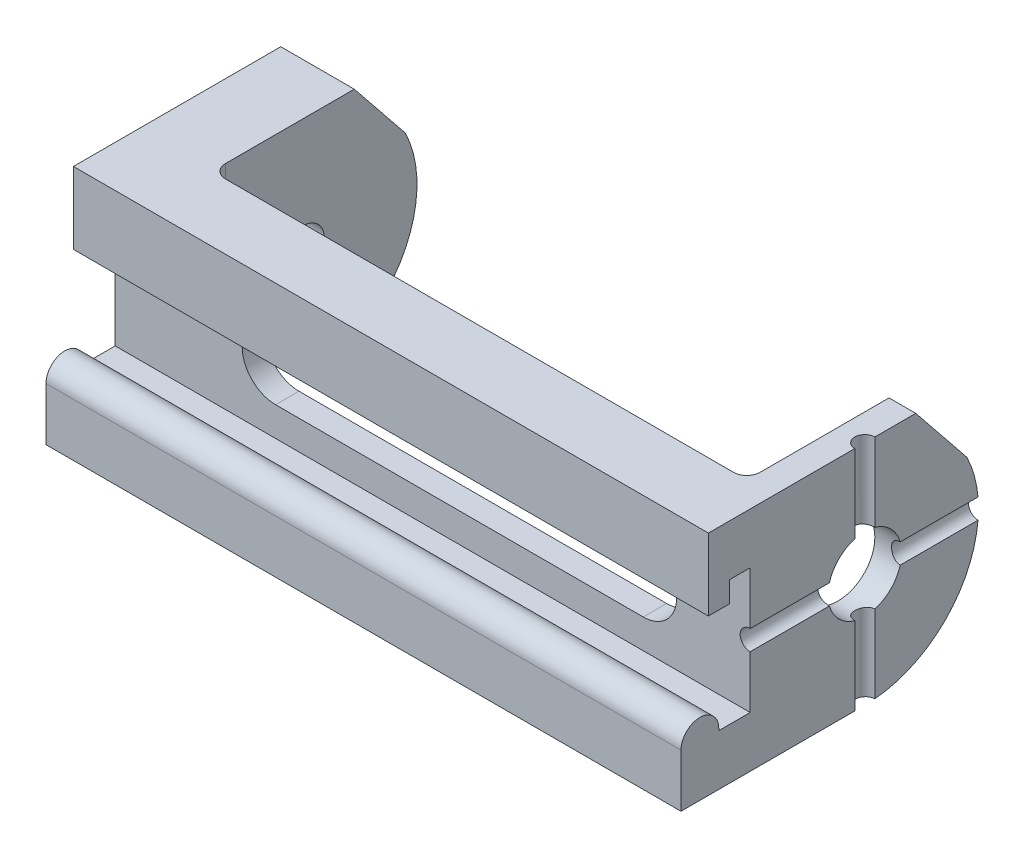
ISO-10303-21;
HEADER;
FILE_DESCRIPTION(('STEP AP214'),'2;1');
FILE_NAME('part.step','',(''),(''),'','','');
FILE_SCHEMA(('AUTOMOTIVE_DESIGN { 1 0 10303 214 1 1 1 1 }'));
ENDSEC;
DATA;
#1=APPLICATION_CONTEXT('core data for automotive mechanical design processes');
#2=APPLICATION_PROTOCOL_DEFINITION('international standard','automotive_design',2000,#1);
#3=PRODUCT_CONTEXT('',#1,'mechanical');
#4=PRODUCT('Part','Part','',(#3));
#5=PRODUCT_RELATED_PRODUCT_CATEGORY('part','',(#4));
#6=PRODUCT_DEFINITION_FORMATION('','',#4);
#7=PRODUCT_DEFINITION_CONTEXT('part definition',#1,'design');
#8=PRODUCT_DEFINITION('design','',#6,#7);
#9=PRODUCT_DEFINITION_SHAPE('','',#8);
#10=(LENGTH_UNIT() NAMED_UNIT(*) SI_UNIT(.MILLI.,.METRE.));
#11=(NAMED_UNIT(*) PLANE_ANGLE_UNIT() SI_UNIT($,.RADIAN.));
#12=(NAMED_UNIT(*) SI_UNIT($,.STERADIAN.) SOLID_ANGLE_UNIT());
#13=UNCERTAINTY_MEASURE_WITH_UNIT(LENGTH_MEASURE(1.E-05),#10,'distance_accuracy_value','');
#14=(GEOMETRIC_REPRESENTATION_CONTEXT(3) GLOBAL_UNCERTAINTY_ASSIGNED_CONTEXT((#13)) GLOBAL_UNIT_ASSIGNED_CONTEXT((#10,
#11,#12)) REPRESENTATION_CONTEXT('',''));
#15=CARTESIAN_POINT('',(0.,0.,0.));
#16=DIRECTION('',(0.,0.,1.));
#17=DIRECTION('',(1.,0.,0.));
#18=AXIS2_PLACEMENT_3D('',#15,#16,#17);
#19=CARTESIAN_POINT('',(48.26,0.,0.));
#20=DIRECTION('',(1.,0.,0.));
#21=DIRECTION('',(0.,0.,-1.));
#22=AXIS2_PLACEMENT_3D('',#19,#20,#21);
#23=PLANE('',#22);
#24=DIRECTION('',(0.,1.,0.));
#25=VECTOR('',#24,1.);
#26=CARTESIAN_POINT('',(48.26,-8.636,-0.761999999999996));
#27=LINE('',#26,#25);
#28=CARTESIAN_POINT('',(48.26,2.68808333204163,-0.761999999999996));
#29=VERTEX_POINT('',#28);
#30=CARTESIAN_POINT('',(48.26,8.636,-0.761999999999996));
#31=VERTEX_POINT('',#30);
#32=EDGE_CURVE('E513',#29,#31,#27,.T.);
#33=ORIENTED_EDGE('',*,*,#32,.F.);
#34=CARTESIAN_POINT('',(48.26,0.,0.));
#35=DIRECTION('',(1.,0.,0.));
#36=DIRECTION('',(0.,0.,-1.));
#37=AXIS2_PLACEMENT_3D('',#34,#35,#36);
#38=CIRCLE('',#37,2.794);
#39=CARTESIAN_POINT('',(48.26,0.761999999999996,-2.68808333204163));
#40=VERTEX_POINT('',#39);
#41=EDGE_CURVE('E549',#40,#29,#38,.T.);
#42=ORIENTED_EDGE('',*,*,#41,.F.);
#43=DIRECTION('',(0.,0.,1.));
#44=VECTOR('',#43,1.);
#45=CARTESIAN_POINT('',(48.26,0.761999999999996,-8.636));
#46=LINE('',#45,#44);
#47=CARTESIAN_POINT('',(48.26,0.761999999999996,-8.60231666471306));
#48=VERTEX_POINT('',#47);
#49=EDGE_CURVE('E488',#48,#40,#46,.T.);
#50=ORIENTED_EDGE('',*,*,#49,.F.);
#51=CARTESIAN_POINT('',(48.26,0.,0.));
#52=DIRECTION('',(1.,0.,0.));
#53=DIRECTION('',(0.,0.,-1.));
#54=AXIS2_PLACEMENT_3D('',#51,#52,#53);
#55=CIRCLE('',#54,8.636);
#56=CARTESIAN_POINT('',(48.26,3.81514439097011,-7.74759119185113));
#57=VERTEX_POINT('',#56);
#58=EDGE_CURVE('E351',#48,#57,#55,.T.);
#59=ORIENTED_EDGE('',*,*,#58,.T.);
#60=DIRECTION('',(0.,0.779493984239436,0.626409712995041));
#61=VECTOR('',#60,1.);
#62=CARTESIAN_POINT('',(48.26,3.81514439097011,-7.74759119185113));
#63=LINE('',#62,#61);
#64=CARTESIAN_POINT('',(48.26,8.636,-3.8735));
#65=VERTEX_POINT('',#64);
#66=EDGE_CURVE('E622',#57,#65,#63,.T.);
#67=ORIENTED_EDGE('',*,*,#66,.T.);
#68=DIRECTION('',(0.,0.,1.));
#69=VECTOR('',#68,1.);
#70=CARTESIAN_POINT('',(48.26,8.636,11.8872));
#71=LINE('',#70,#69);
#72=EDGE_CURVE('E625',#65,#31,#71,.T.);
#73=ORIENTED_EDGE('',*,*,#72,.T.);
#74=EDGE_LOOP('',(#33,#42,#50,#59,#67,#73));
#75=FACE_BOUND('',#74,.T.);
#76=ADVANCED_FACE('F38',(#75),#23,.T.);
#77=DIRECTION('',(0.,1.,0.));
#78=VECTOR('',#77,1.);
#79=CARTESIAN_POINT('',(48.26,-8.636,-0.761999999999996));
#80=LINE('',#79,#78);
#81=CARTESIAN_POINT('',(48.26,-8.60231666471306,-0.761999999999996));
#82=VERTEX_POINT('',#81);
#83=CARTESIAN_POINT('',(48.26,-2.68808333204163,-0.761999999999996));
#84=VERTEX_POINT('',#83);
#85=EDGE_CURVE('E60',#82,#84,#80,.T.);
#86=ORIENTED_EDGE('',*,*,#85,.F.);
#87=CARTESIAN_POINT('',(48.26,-0.761999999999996,-8.60231666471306));
#88=VERTEX_POINT('',#87);
#89=EDGE_CURVE('E620',#82,#88,#55,.T.);
#90=ORIENTED_EDGE('',*,*,#89,.T.);
#91=DIRECTION('',(0.,0.,1.));
#92=VECTOR('',#91,1.);
#93=CARTESIAN_POINT('',(48.26,-0.761999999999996,-8.636));
#94=LINE('',#93,#92);
#95=CARTESIAN_POINT('',(48.26,-0.761999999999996,-2.68808333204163));
#96=VERTEX_POINT('',#95);
#97=EDGE_CURVE('E514',#96,#88,#94,.F.);
#98=ORIENTED_EDGE('',*,*,#97,.F.);
#99=EDGE_CURVE('E548',#84,#96,#38,.T.);
#100=ORIENTED_EDGE('',*,*,#99,.F.);
#101=EDGE_LOOP('',(#86,#90,#98,#100));
#102=FACE_BOUND('',#101,.T.);
#103=ADVANCED_FACE('F775',(#102),#23,.T.);
#104=DIRECTION('',(0.,1.,0.));
#105=VECTOR('',#104,1.);
#106=CARTESIAN_POINT('',(48.26,-8.636,0.761999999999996));
#107=LINE('',#106,#105);
#108=CARTESIAN_POINT('',(48.26,8.636,0.761999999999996));
#109=VERTEX_POINT('',#108);
#110=CARTESIAN_POINT('',(48.26,2.68808333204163,0.761999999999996));
#111=VERTEX_POINT('',#110);
#112=EDGE_CURVE('E68',#109,#111,#107,.F.);
#113=ORIENTED_EDGE('',*,*,#112,.F.);
#114=CARTESIAN_POINT('',(48.26,8.636,11.8872));
#115=VERTEX_POINT('',#114);
#116=EDGE_CURVE('E624',#109,#115,#71,.T.);
#117=ORIENTED_EDGE('',*,*,#116,.T.);
#118=DIRECTION('',(0.,-1.,0.));
#119=VECTOR('',#118,1.);
#120=CARTESIAN_POINT('',(48.26,3.175,11.8872));
#121=LINE('',#120,#119);
#122=CARTESIAN_POINT('',(48.26,3.175,11.8872));
#123=VERTEX_POINT('',#122);
#124=EDGE_CURVE('E628',#115,#123,#121,.T.);
#125=ORIENTED_EDGE('',*,*,#124,.T.);
#126=DIRECTION('',(0.,0.,-1.));
#127=VECTOR('',#126,1.);
#128=CARTESIAN_POINT('',(48.26,3.175,10.287));
#129=LINE('',#128,#127);
#130=CARTESIAN_POINT('',(48.26,3.175,10.287));
#131=VERTEX_POINT('',#130);
#132=EDGE_CURVE('E630',#123,#131,#129,.T.);
#133=ORIENTED_EDGE('',*,*,#132,.T.);
#134=DIRECTION('',(0.,1.,0.));
#135=VECTOR('',#134,1.);
#136=CARTESIAN_POINT('',(48.26,4.7625,10.287));
#137=LINE('',#136,#135);
#138=CARTESIAN_POINT('',(48.26,4.7625,10.287));
#139=VERTEX_POINT('',#138);
#140=EDGE_CURVE('E632',#131,#139,#137,.T.);
#141=ORIENTED_EDGE('',*,*,#140,.T.);
#142=DIRECTION('',(0.,0.,-1.));
#143=VECTOR('',#142,1.);
#144=CARTESIAN_POINT('',(48.26,4.7625,8.7122));
#145=LINE('',#144,#143);
#146=CARTESIAN_POINT('',(48.26,4.7625,8.7122));
#147=VERTEX_POINT('',#146);
#148=EDGE_CURVE('E634',#139,#147,#145,.T.);
#149=ORIENTED_EDGE('',*,*,#148,.T.);
#150=DIRECTION('',(0.,-1.,0.));
#151=VECTOR('',#150,1.);
#152=CARTESIAN_POINT('',(48.26,-4.7625,8.7122));
#153=LINE('',#152,#151);
#154=CARTESIAN_POINT('',(48.26,0.761999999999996,8.7122));
#155=VERTEX_POINT('',#154);
#156=EDGE_CURVE('E637',#147,#155,#153,.T.);
#157=ORIENTED_EDGE('',*,*,#156,.T.);
#158=CARTESIAN_POINT('',(48.26,0.761999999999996,2.68808333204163));
#159=VERTEX_POINT('',#158);
#160=EDGE_CURVE('E519',#159,#155,#46,.T.);
#161=ORIENTED_EDGE('',*,*,#160,.F.);
#162=EDGE_CURVE('E553',#111,#159,#38,.T.);
#163=ORIENTED_EDGE('',*,*,#162,.F.);
#164=EDGE_LOOP('',(#113,#117,#125,#133,#141,#149,#157,#161,#163));
#165=FACE_BOUND('',#164,.T.);
#166=ADVANCED_FACE('F741',(#165),#23,.T.);
#167=CARTESIAN_POINT('',(0.,-4.6101,12.5349));
#168=DIRECTION('',(-1.,0.,0.));
#169=DIRECTION('',(0.,0.,1.));
#170=AXIS2_PLACEMENT_3D('',#167,#168,#169);
#171=CYLINDRICAL_SURFACE('',#170,1.4351);
#172=DIRECTION('',(-1.,0.,0.));
#173=VECTOR('',#172,1.);
#174=CARTESIAN_POINT('',(48.26,-4.6101,11.0998));
#175=LINE('',#174,#173);
#176=CARTESIAN_POINT('',(0.,-4.6101,11.0998));
#177=VERTEX_POINT('',#176);
#178=CARTESIAN_POINT('',(48.26,-4.6101,11.0998));
#179=VERTEX_POINT('',#178);
#180=EDGE_CURVE('E438',#177,#179,#175,.F.);
#181=ORIENTED_EDGE('',*,*,#180,.F.);
#182=CARTESIAN_POINT('',(0.,-4.6101,12.5349));
#183=DIRECTION('',(1.,0.,0.));
#184=DIRECTION('',(0.,0.,-1.));
#185=AXIS2_PLACEMENT_3D('',#182,#183,#184);
#186=CIRCLE('',#185,1.4351);
#187=CARTESIAN_POINT('',(0.,-4.6101,13.97));
#188=VERTEX_POINT('',#187);
#189=EDGE_CURVE('E444',#188,#177,#186,.F.);
#190=ORIENTED_EDGE('',*,*,#189,.F.);
#191=DIRECTION('',(-1.,0.,0.));
#192=VECTOR('',#191,1.);
#193=CARTESIAN_POINT('',(48.26,-4.6101,13.97));
#194=LINE('',#193,#192);
#195=CARTESIAN_POINT('',(48.26,-4.6101,13.97));
#196=VERTEX_POINT('',#195);
#197=EDGE_CURVE('E441',#196,#188,#194,.T.);
#198=ORIENTED_EDGE('',*,*,#197,.F.);
#199=CARTESIAN_POINT('',(48.26,-4.6101,12.5349));
#200=DIRECTION('',(1.,0.,0.));
#201=DIRECTION('',(0.,0.,-1.));
#202=AXIS2_PLACEMENT_3D('',#199,#200,#201);
#203=CIRCLE('',#202,1.4351);
#204=EDGE_CURVE('E446',#179,#196,#203,.T.);
#205=ORIENTED_EDGE('',*,*,#204,.F.);
#206=EDGE_LOOP('',(#181,#190,#198,#205));
#207=FACE_BOUND('',#206,.T.);
#208=ADVANCED_FACE('F41',(#207),#171,.T.);
#209=CARTESIAN_POINT('',(48.26,0.,0.));
#210=DIRECTION('',(-1.,0.,0.));
#211=DIRECTION('',(0.,0.,1.));
#212=AXIS2_PLACEMENT_3D('',#209,#210,#211);
#213=CYLINDRICAL_SURFACE('',#212,8.636);
#214=CARTESIAN_POINT('',(5.588,0.,0.));
#215=DIRECTION('',(1.,0.,0.));
#216=DIRECTION('',(0.,0.,-1.));
#217=AXIS2_PLACEMENT_3D('',#214,#215,#216);
#218=CIRCLE('',#217,8.636);
#219=CARTESIAN_POINT('',(5.588,-8.2045651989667,-2.69547878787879));
#220=VERTEX_POINT('',#219);
#221=CARTESIAN_POINT('',(5.588,3.81514439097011,-7.74759119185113));
#222=VERTEX_POINT('',#221);
#223=EDGE_CURVE('E327',#220,#222,#218,.T.);
#224=ORIENTED_EDGE('',*,*,#223,.F.);
#225=DIRECTION('',(-1.,0.,0.));
#226=VECTOR('',#225,1.);
#227=CARTESIAN_POINT('',(48.26,-8.2045651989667,-2.69547878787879));
#228=LINE('',#227,#226);
#229=CARTESIAN_POINT('',(0.,-8.2045651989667,-2.69547878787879));
#230=VERTEX_POINT('',#229);
#231=EDGE_CURVE('E418',#220,#230,#228,.T.);
#232=ORIENTED_EDGE('',*,*,#231,.T.);
#233=CARTESIAN_POINT('',(0.,0.,0.));
#234=DIRECTION('',(1.,0.,0.));
#235=DIRECTION('',(0.,0.,-1.));
#236=AXIS2_PLACEMENT_3D('',#233,#234,#235);
#237=CIRCLE('',#236,8.636);
#238=CARTESIAN_POINT('',(0.,3.81514439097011,-7.74759119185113));
#239=VERTEX_POINT('',#238);
#240=EDGE_CURVE('E324',#230,#239,#237,.T.);
#241=ORIENTED_EDGE('',*,*,#240,.T.);
#242=DIRECTION('',(-1.,0.,0.));
#243=VECTOR('',#242,1.);
#244=CARTESIAN_POINT('',(48.26,3.81514439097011,-7.74759119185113));
#245=LINE('',#244,#243);
#246=EDGE_CURVE('E379',#222,#239,#245,.T.);
#247=ORIENTED_EDGE('',*,*,#246,.F.);
#248=EDGE_LOOP('',(#224,#232,#241,#247));
#249=FACE_BOUND('',#248,.T.);
#250=ADVANCED_FACE('F499',(#249),#213,.T.);
#251=CARTESIAN_POINT('',(48.26,3.81514439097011,-7.74759119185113));
#252=DIRECTION('',(0.,-0.626409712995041,0.779493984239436));
#253=DIRECTION('',(0.,-0.779493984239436,-0.626409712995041));
#254=AXIS2_PLACEMENT_3D('',#251,#252,#253);
#255=PLANE('',#254);
#256=DIRECTION('',(0.,0.779493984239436,0.626409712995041));
#257=VECTOR('',#256,1.);
#258=CARTESIAN_POINT('',(5.588,3.81514439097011,-7.74759119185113));
#259=LINE('',#258,#257);
#260=CARTESIAN_POINT('',(5.588,8.636,-3.8735));
#261=VERTEX_POINT('',#260);
#262=EDGE_CURVE('E617',#222,#261,#259,.T.);
#263=ORIENTED_EDGE('',*,*,#262,.F.);
#264=ORIENTED_EDGE('',*,*,#246,.T.);
#265=DIRECTION('',(0.,0.779493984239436,0.626409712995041));
#266=VECTOR('',#265,1.);
#267=CARTESIAN_POINT('',(0.,3.81514439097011,-7.74759119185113));
#268=LINE('',#267,#266);
#269=CARTESIAN_POINT('',(0.,8.636,-3.8735));
#270=VERTEX_POINT('',#269);
#271=EDGE_CURVE('E326',#239,#270,#268,.T.);
#272=ORIENTED_EDGE('',*,*,#271,.T.);
#273=DIRECTION('',(-1.,0.,0.));
#274=VECTOR('',#273,1.);
#275=CARTESIAN_POINT('',(48.26,8.636,-3.8735));
#276=LINE('',#275,#274);
#277=EDGE_CURVE('E375',#261,#270,#276,.T.);
#278=ORIENTED_EDGE('',*,*,#277,.F.);
#279=EDGE_LOOP('',(#263,#264,#272,#278));
#280=FACE_BOUND('',#279,.T.);
#281=ADVANCED_FACE('F699',(#280),#255,.F.);
#282=CARTESIAN_POINT('',(48.26,8.636,11.8872));
#283=DIRECTION('',(0.,-1.,0.));
#284=DIRECTION('',(0.,0.,-1.));
#285=AXIS2_PLACEMENT_3D('',#282,#283,#284);
#286=PLANE('',#285);
#287=ORIENTED_EDGE('',*,*,#116,.F.);
#288=CARTESIAN_POINT('',(48.26,8.636,0.));
#289=DIRECTION('',(0.,1.,0.));
#290=DIRECTION('',(0.,0.,1.));
#291=AXIS2_PLACEMENT_3D('',#288,#289,#290);
#292=CIRCLE('',#291,0.761999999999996);
#293=EDGE_CURVE('E311',#31,#109,#292,.T.);
#294=ORIENTED_EDGE('',*,*,#293,.F.);
#295=ORIENTED_EDGE('',*,*,#72,.F.);
#296=CARTESIAN_POINT('',(46.228,8.636,-3.8735));
#297=VERTEX_POINT('',#296);
#298=EDGE_CURVE('E376',#65,#297,#276,.T.);
#299=ORIENTED_EDGE('',*,*,#298,.T.);
#300=DIRECTION('',(0.,0.,1.));
#301=VECTOR('',#300,1.);
#302=CARTESIAN_POINT('',(46.228,8.636,6.9342));
#303=LINE('',#302,#301);
#304=CARTESIAN_POINT('',(46.228,8.636,5.9182));
#305=VERTEX_POINT('',#304);
#306=EDGE_CURVE('E599',#297,#305,#303,.T.);
#307=ORIENTED_EDGE('',*,*,#306,.T.);
#308=CARTESIAN_POINT('',(45.212,8.636,5.9182));
#309=DIRECTION('',(0.,-1.,0.));
#310=DIRECTION('',(0.,0.,-1.));
#311=AXIS2_PLACEMENT_3D('',#308,#309,#310);
#312=CIRCLE('',#311,1.016);
#313=CARTESIAN_POINT('',(45.212,8.636,6.9342));
#314=VERTEX_POINT('',#313);
#315=EDGE_CURVE('E395',#305,#314,#312,.T.);
#316=ORIENTED_EDGE('',*,*,#315,.T.);
#317=DIRECTION('',(1.,0.,0.));
#318=VECTOR('',#317,1.);
#319=CARTESIAN_POINT('',(5.588,8.636,6.9342));
#320=LINE('',#319,#318);
#321=CARTESIAN_POINT('',(6.604,8.636,6.9342));
#322=VERTEX_POINT('',#321);
#323=EDGE_CURVE('E606',#322,#314,#320,.T.);
#324=ORIENTED_EDGE('',*,*,#323,.F.);
#325=CARTESIAN_POINT('',(6.604,8.636,5.9182));
#326=DIRECTION('',(0.,-1.,0.));
#327=DIRECTION('',(0.,0.,-1.));
#328=AXIS2_PLACEMENT_3D('',#325,#326,#327);
#329=CIRCLE('',#328,1.016);
#330=CARTESIAN_POINT('',(5.588,8.636,5.9182));
#331=VERTEX_POINT('',#330);
#332=EDGE_CURVE('E399',#322,#331,#329,.T.);
#333=ORIENTED_EDGE('',*,*,#332,.T.);
#334=DIRECTION('',(0.,0.,1.));
#335=VECTOR('',#334,1.);
#336=CARTESIAN_POINT('',(5.588,8.636,6.9342));
#337=LINE('',#336,#335);
#338=EDGE_CURVE('E598',#261,#331,#337,.T.);
#339=ORIENTED_EDGE('',*,*,#338,.F.);
#340=ORIENTED_EDGE('',*,*,#277,.T.);
#341=DIRECTION('',(0.,0.,1.));
#342=VECTOR('',#341,1.);
#343=CARTESIAN_POINT('',(0.,8.636,11.8872));
#344=LINE('',#343,#342);
#345=CARTESIAN_POINT('',(0.,8.636,11.8872));
#346=VERTEX_POINT('',#345);
#347=EDGE_CURVE('E330',#270,#346,#344,.T.);
#348=ORIENTED_EDGE('',*,*,#347,.T.);
#349=DIRECTION('',(-1.,0.,0.));
#350=VECTOR('',#349,1.);
#351=CARTESIAN_POINT('',(48.26,8.636,11.8872));
#352=LINE('',#351,#350);
#353=EDGE_CURVE('E372',#115,#346,#352,.T.);
#354=ORIENTED_EDGE('',*,*,#353,.F.);
#355=EDGE_LOOP('',(#287,#294,#295,#299,#307,#316,#324,#333,#339,#340,#348,#354));
#356=FACE_BOUND('',#355,.T.);
#357=ADVANCED_FACE('F704',(#356),#286,.F.);
#358=CARTESIAN_POINT('',(48.26,-8.636,0.));
#359=DIRECTION('',(0.,1.,0.));
#360=DIRECTION('',(0.,0.,1.));
#361=AXIS2_PLACEMENT_3D('',#358,#359,#360);
#362=PLANE('',#361);
#363=DIRECTION('',(-1.,0.,0.));
#364=VECTOR('',#363,1.);
#365=CARTESIAN_POINT('',(48.26,-8.636,0.));
#366=LINE('',#365,#364);
#367=CARTESIAN_POINT('',(47.498,-8.636,0.));
#368=VERTEX_POINT('',#367);
#369=CARTESIAN_POINT('',(46.228,-8.636,0.));
#370=VERTEX_POINT('',#369);
#371=EDGE_CURVE('E310',#368,#370,#366,.T.);
#372=ORIENTED_EDGE('',*,*,#371,.F.);
#373=CARTESIAN_POINT('',(48.26,-8.636,0.));
#374=DIRECTION('',(0.,1.,0.));
#375=DIRECTION('',(0.,0.,1.));
#376=AXIS2_PLACEMENT_3D('',#373,#374,#375);
#377=CIRCLE('',#376,0.761999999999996);
#378=CARTESIAN_POINT('',(48.26,-8.636,0.761999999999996));
#379=VERTEX_POINT('',#378);
#380=EDGE_CURVE('E296',#368,#379,#377,.T.);
#381=ORIENTED_EDGE('',*,*,#380,.T.);
#382=DIRECTION('',(0.,0.,-1.));
#383=VECTOR('',#382,1.);
#384=CARTESIAN_POINT('',(48.26,-8.636,0.));
#385=LINE('',#384,#383);
#386=CARTESIAN_POINT('',(48.26,-8.636,13.97));
#387=VERTEX_POINT('',#386);
#388=EDGE_CURVE('E308',#387,#379,#385,.T.);
#389=ORIENTED_EDGE('',*,*,#388,.F.);
#390=DIRECTION('',(-1.,0.,0.));
#391=VECTOR('',#390,1.);
#392=CARTESIAN_POINT('',(48.26,-8.636,13.97));
#393=LINE('',#392,#391);
#394=CARTESIAN_POINT('',(0.,-8.636,13.97));
#395=VERTEX_POINT('',#394);
#396=EDGE_CURVE('E318',#387,#395,#393,.T.);
#397=ORIENTED_EDGE('',*,*,#396,.T.);
#398=DIRECTION('',(0.,0.,-1.));
#399=VECTOR('',#398,1.);
#400=CARTESIAN_POINT('',(0.,-8.636,0.));
#401=LINE('',#400,#399);
#402=CARTESIAN_POINT('',(0.,-8.636,2.6162));
#403=VERTEX_POINT('',#402);
#404=EDGE_CURVE('E349',#395,#403,#401,.T.);
#405=ORIENTED_EDGE('',*,*,#404,.T.);
#406=DIRECTION('',(-1.,0.,0.));
#407=VECTOR('',#406,1.);
#408=CARTESIAN_POINT('',(48.26,-8.636,2.6162));
#409=LINE('',#408,#407);
#410=CARTESIAN_POINT('',(5.588,-8.636,2.6162));
#411=VERTEX_POINT('',#410);
#412=EDGE_CURVE('E409',#403,#411,#409,.F.);
#413=ORIENTED_EDGE('',*,*,#412,.T.);
#414=DIRECTION('',(0.,0.,-1.));
#415=VECTOR('',#414,1.);
#416=CARTESIAN_POINT('',(5.588,-8.636,6.9342));
#417=LINE('',#416,#415);
#418=CARTESIAN_POINT('',(5.588,-8.636,5.9182));
#419=VERTEX_POINT('',#418);
#420=EDGE_CURVE('E595',#419,#411,#417,.T.);
#421=ORIENTED_EDGE('',*,*,#420,.F.);
#422=CARTESIAN_POINT('',(6.604,-8.636,5.9182));
#423=DIRECTION('',(0.,1.,0.));
#424=DIRECTION('',(0.,0.,1.));
#425=AXIS2_PLACEMENT_3D('',#422,#423,#424);
#426=CIRCLE('',#425,1.016);
#427=CARTESIAN_POINT('',(6.604,-8.636,6.9342));
#428=VERTEX_POINT('',#427);
#429=EDGE_CURVE('E397',#419,#428,#426,.T.);
#430=ORIENTED_EDGE('',*,*,#429,.T.);
#431=DIRECTION('',(1.,0.,0.));
#432=VECTOR('',#431,1.);
#433=CARTESIAN_POINT('',(5.588,-8.636,6.9342));
#434=LINE('',#433,#432);
#435=CARTESIAN_POINT('',(45.212,-8.636,6.9342));
#436=VERTEX_POINT('',#435);
#437=EDGE_CURVE('E602',#428,#436,#434,.T.);
#438=ORIENTED_EDGE('',*,*,#437,.T.);
#439=CARTESIAN_POINT('',(45.212,-8.636,5.9182));
#440=DIRECTION('',(0.,1.,0.));
#441=DIRECTION('',(0.,0.,1.));
#442=AXIS2_PLACEMENT_3D('',#439,#440,#441);
#443=CIRCLE('',#442,1.016);
#444=CARTESIAN_POINT('',(46.228,-8.636,5.9182));
#445=VERTEX_POINT('',#444);
#446=EDGE_CURVE('E393',#436,#445,#443,.T.);
#447=ORIENTED_EDGE('',*,*,#446,.T.);
#448=DIRECTION('',(0.,0.,-1.));
#449=VECTOR('',#448,1.);
#450=CARTESIAN_POINT('',(46.228,-8.636,6.9342));
#451=LINE('',#450,#449);
#452=EDGE_CURVE('E594',#445,#370,#451,.T.);
#453=ORIENTED_EDGE('',*,*,#452,.T.);
#454=EDGE_LOOP('',(#372,#381,#389,#397,#405,#413,#421,#430,#438,#447,#453));
#455=FACE_BOUND('',#454,.T.);
#456=ADVANCED_FACE('F306',(#455),#362,.F.);
#457=ORIENTED_EDGE('',*,*,#89,.F.);
#458=CARTESIAN_POINT('',(48.26,-8.60231666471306,-0.761999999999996));
#459=CARTESIAN_POINT('',(48.2172190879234,-8.60230431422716,-0.762036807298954));
#460=CARTESIAN_POINT('',(48.174450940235,-8.60263545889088,-0.758399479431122));
#461=CARTESIAN_POINT('',(48.0901671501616,-8.60389318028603,-0.744050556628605));
#462=CARTESIAN_POINT('',(48.0486503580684,-8.6048191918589,-0.733345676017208));
#463=CARTESIAN_POINT('',(47.9679939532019,-8.60717589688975,-0.705128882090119));
#464=CARTESIAN_POINT('',(47.9288553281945,-8.60860679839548,-0.687614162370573));
#465=CARTESIAN_POINT('',(47.8540769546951,-8.61180773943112,-0.646292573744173));
#466=CARTESIAN_POINT('',(47.8184368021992,-8.61357773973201,-0.622486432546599));
#467=CARTESIAN_POINT('',(47.7515663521,-8.61726385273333,-0.56918550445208));
#468=CARTESIAN_POINT('',(47.7203469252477,-8.61918030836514,-0.539677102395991));
#469=CARTESIAN_POINT('',(47.6632920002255,-8.62294034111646,-0.475832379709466));
#470=CARTESIAN_POINT('',(47.6374575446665,-8.62478390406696,-0.441495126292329));
#471=CARTESIAN_POINT('',(47.5918692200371,-8.62819396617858,-0.368898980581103));
#472=CARTESIAN_POINT('',(47.5721266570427,-8.62975994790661,-0.33063297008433));
#473=CARTESIAN_POINT('',(47.5393613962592,-8.63243324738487,-0.251320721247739));
#474=CARTESIAN_POINT('',(47.5263346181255,-8.63354084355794,-0.210276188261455));
#475=CARTESIAN_POINT('',(47.5105882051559,-8.63489613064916,-0.140819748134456));
#476=CARTESIAN_POINT('',(47.505870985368,-8.63530808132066,-0.112847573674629));
#477=CARTESIAN_POINT('',(47.4995770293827,-8.63586083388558,-0.0565876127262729));
#478=CARTESIAN_POINT('',(47.4979960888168,-8.63600199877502,-0.0283002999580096));
#479=CARTESIAN_POINT('',(47.498,-8.636,0.));
#480=B_SPLINE_CURVE_WITH_KNOTS('',3,(#458,#459,#460,#461,#462,#463,#464,#465,#466,#467,#468,
#469,#470,#471,#472,#473,#474,#475,#476,#477,#478,#479),.UNSPECIFIED.,.F.,.F.,(4,2,2,2,2,2,2,2,
2,2,4),(0.,0.128168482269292,0.256215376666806,0.384315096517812,0.512400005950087,
0.640794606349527,0.769214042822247,0.897870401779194,1.02644849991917,1.11139369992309,
1.19622494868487),.UNSPECIFIED.);
#481=EDGE_CURVE('E505',#82,#368,#480,.T.);
#482=ORIENTED_EDGE('',*,*,#481,.T.);
#483=ORIENTED_EDGE('',*,*,#371,.T.);
#484=CARTESIAN_POINT('',(46.228,0.,0.));
#485=DIRECTION('',(1.,0.,0.));
#486=DIRECTION('',(0.,0.,-1.));
#487=AXIS2_PLACEMENT_3D('',#484,#485,#486);
#488=CIRCLE('',#487,8.636);
#489=CARTESIAN_POINT('',(46.228,3.81514439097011,-7.74759119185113));
#490=VERTEX_POINT('',#489);
#491=EDGE_CURVE('E614',#370,#490,#488,.T.);
#492=ORIENTED_EDGE('',*,*,#491,.T.);
#493=EDGE_CURVE('E380',#57,#490,#245,.T.);
#494=ORIENTED_EDGE('',*,*,#493,.F.);
#495=ORIENTED_EDGE('',*,*,#58,.F.);
#496=CARTESIAN_POINT('',(48.26,0.761999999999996,-8.60231666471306));
#497=CARTESIAN_POINT('',(48.2172202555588,0.762036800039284,-8.6023043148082));
#498=CARTESIAN_POINT('',(48.1744532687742,0.758399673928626,-8.60263544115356));
#499=CARTESIAN_POINT('',(48.0901694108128,0.744051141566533,-8.60389313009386));
#500=CARTESIAN_POINT('',(48.0486514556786,0.733346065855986,-8.60481915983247));
#501=CARTESIAN_POINT('',(47.9679935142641,0.705128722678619,-8.60717590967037));
#502=CARTESIAN_POINT('',(47.928854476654,0.687613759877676,-8.60860682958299));
#503=CARTESIAN_POINT('',(47.8540761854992,0.646292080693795,-8.61180777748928));
#504=CARTESIAN_POINT('',(47.8184364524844,0.622486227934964,-8.61357775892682));
#505=CARTESIAN_POINT('',(47.7515656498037,0.569184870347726,-8.61726389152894));
#506=CARTESIAN_POINT('',(47.7203455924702,0.539675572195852,-8.61918039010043));
#507=CARTESIAN_POINT('',(47.6632909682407,0.475831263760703,-8.62294041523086));
#508=CARTESIAN_POINT('',(47.6374572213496,0.441495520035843,-8.6247839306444));
#509=CARTESIAN_POINT('',(47.5918750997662,0.368907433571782,-8.62819352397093));
#510=CARTESIAN_POINT('',(47.57213653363,0.330648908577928,-8.62975915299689));
#511=CARTESIAN_POINT('',(47.5393688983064,0.251346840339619,-8.63243262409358));
#512=CARTESIAN_POINT('',(47.5263392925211,0.210303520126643,-8.63354050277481));
#513=CARTESIAN_POINT('',(47.5073905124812,0.12670823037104,-8.63517129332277));
#514=CARTESIAN_POINT('',(47.5014529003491,0.0841604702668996,-8.63569572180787));
#515=CARTESIAN_POINT('',(47.4967996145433,-0.00133178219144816,-8.63610567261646));
#516=CARTESIAN_POINT('',(47.4980839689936,-0.0442762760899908,-8.63599119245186));
#517=CARTESIAN_POINT('',(47.5078233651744,-0.129215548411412,-8.6351374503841));
#518=CARTESIAN_POINT('',(47.5162583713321,-0.171212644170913,-8.63439993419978));
#519=CARTESIAN_POINT('',(47.5400284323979,-0.253192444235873,-8.63238506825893));
#520=CARTESIAN_POINT('',(47.5553635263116,-0.293175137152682,-8.63110771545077));
#521=CARTESIAN_POINT('',(47.5925210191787,-0.370055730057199,-8.62815382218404));
#522=CARTESIAN_POINT('',(47.6143524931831,-0.406949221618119,-8.62647672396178));
#523=CARTESIAN_POINT('',(47.6638754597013,-0.476554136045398,-8.62291183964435));
#524=CARTESIAN_POINT('',(47.6915668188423,-0.509265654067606,-8.62102405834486));
#525=CARTESIAN_POINT('',(47.752131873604,-0.569692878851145,-8.6172424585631));
#526=CARTESIAN_POINT('',(47.7850222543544,-0.597391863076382,-8.61534864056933));
#527=CARTESIAN_POINT('',(47.8550077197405,-0.646886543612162,-8.61177402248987));
#528=CARTESIAN_POINT('',(47.8921040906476,-0.668680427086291,-8.61009328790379));
#529=CARTESIAN_POINT('',(47.9694654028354,-0.705745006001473,-8.60713467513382));
#530=CARTESIAN_POINT('',(48.0097326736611,-0.721010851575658,-8.6058570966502));
#531=CARTESIAN_POINT('',(48.0922423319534,-0.744537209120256,-8.6038539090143));
#532=CARTESIAN_POINT('',(48.1344816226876,-0.752808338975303,-8.60312746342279));
#533=CARTESIAN_POINT('',(48.1908444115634,-0.758982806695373,-8.60258344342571));
#534=CARTESIAN_POINT('',(48.204663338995,-0.760114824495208,-8.60248346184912));
#535=CARTESIAN_POINT('',(48.2323196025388,-0.761622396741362,-8.6023501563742));
#536=CARTESIAN_POINT('',(48.2461568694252,-0.76199921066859,-8.60231672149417));
#537=CARTESIAN_POINT('',(48.26,-0.761999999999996,-8.60231666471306));
#538=B_SPLINE_CURVE_WITH_KNOTS('',3,(#496,#497,#498,#499,#500,#501,#502,#503,#504,#505,#506,
#507,#508,#509,#510,#511,#512,#513,#514,#515,#516,#517,#518,#519,#520,#521,#522,#523,#524,#525,
#526,#527,#528,#529,#530,#531,#532,#533,#534,#535,#536,#537),.UNSPECIFIED.,.F.,.F.,(4,2,2,2,2,2,
2,2,2,2,2,2,2,2,2,2,2,2,2,2,4),(0.,0.1281650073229,0.256215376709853,0.384316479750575,
0.512400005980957,0.640797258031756,0.769214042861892,0.897836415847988,1.02644849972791,
1.15472548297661,1.28300296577,1.41092220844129,1.53884217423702,1.6669416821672,
1.79503827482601,1.92355463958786,2.0521104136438,2.18076153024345,2.30921700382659,
2.35079891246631,2.39231141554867),.UNSPECIFIED.);
#539=EDGE_CURVE('E478',#48,#88,#538,.T.);
#540=ORIENTED_EDGE('',*,*,#539,.T.);
#541=EDGE_LOOP('',(#457,#482,#483,#492,#494,#495,#540));
#542=FACE_BOUND('',#541,.T.);
#543=ADVANCED_FACE('F492',(#542),#213,.T.);
#544=ORIENTED_EDGE('',*,*,#493,.T.);
#545=DIRECTION('',(0.,0.779493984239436,0.626409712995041));
#546=VECTOR('',#545,1.);
#547=CARTESIAN_POINT('',(46.228,3.81514439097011,-7.74759119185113));
#548=LINE('',#547,#546);
#549=EDGE_CURVE('E609',#490,#297,#548,.T.);
#550=ORIENTED_EDGE('',*,*,#549,.T.);
#551=ORIENTED_EDGE('',*,*,#298,.F.);
#552=ORIENTED_EDGE('',*,*,#66,.F.);
#553=EDGE_LOOP('',(#544,#550,#551,#552));
#554=FACE_BOUND('',#553,.T.);
#555=ADVANCED_FACE('F497',(#554),#255,.F.);
#556=CARTESIAN_POINT('',(48.26,3.175,11.8872));
#557=DIRECTION('',(0.,0.,-1.));
#558=DIRECTION('',(-1.,0.,0.));
#559=AXIS2_PLACEMENT_3D('',#556,#557,#558);
#560=PLANE('',#559);
#561=DIRECTION('',(0.,-1.,0.));
#562=VECTOR('',#561,1.);
#563=CARTESIAN_POINT('',(0.,3.175,11.8872));
#564=LINE('',#563,#562);
#565=CARTESIAN_POINT('',(0.,3.175,11.8872));
#566=VERTEX_POINT('',#565);
#567=EDGE_CURVE('E332',#346,#566,#564,.T.);
#568=ORIENTED_EDGE('',*,*,#567,.T.);
#569=DIRECTION('',(-1.,0.,0.));
#570=VECTOR('',#569,1.);
#571=CARTESIAN_POINT('',(48.26,3.175,11.8872));
#572=LINE('',#571,#570);
#573=EDGE_CURVE('E369',#123,#566,#572,.T.);
#574=ORIENTED_EDGE('',*,*,#573,.F.);
#575=ORIENTED_EDGE('',*,*,#124,.F.);
#576=ORIENTED_EDGE('',*,*,#353,.T.);
#577=EDGE_LOOP('',(#568,#574,#575,#576));
#578=FACE_BOUND('',#577,.T.);
#579=ADVANCED_FACE('F766',(#578),#560,.F.);
#580=CARTESIAN_POINT('',(48.26,3.175,10.287));
#581=DIRECTION('',(0.,1.,0.));
#582=DIRECTION('',(0.,0.,1.));
#583=AXIS2_PLACEMENT_3D('',#580,#581,#582);
#584=PLANE('',#583);
#585=DIRECTION('',(0.,0.,-1.));
#586=VECTOR('',#585,1.);
#587=CARTESIAN_POINT('',(0.,3.175,10.287));
#588=LINE('',#587,#586);
#589=CARTESIAN_POINT('',(0.,3.175,10.287));
#590=VERTEX_POINT('',#589);
#591=EDGE_CURVE('E334',#566,#590,#588,.T.);
#592=ORIENTED_EDGE('',*,*,#591,.T.);
#593=DIRECTION('',(-1.,0.,0.));
#594=VECTOR('',#593,1.);
#595=CARTESIAN_POINT('',(48.26,3.175,10.287));
#596=LINE('',#595,#594);
#597=EDGE_CURVE('E366',#131,#590,#596,.T.);
#598=ORIENTED_EDGE('',*,*,#597,.F.);
#599=ORIENTED_EDGE('',*,*,#132,.F.);
#600=ORIENTED_EDGE('',*,*,#573,.T.);
#601=EDGE_LOOP('',(#592,#598,#599,#600));
#602=FACE_BOUND('',#601,.T.);
#603=ADVANCED_FACE('F764',(#602),#584,.F.);
#604=CARTESIAN_POINT('',(48.26,4.7625,10.287));
#605=DIRECTION('',(0.,0.,1.));
#606=DIRECTION('',(1.,0.,0.));
#607=AXIS2_PLACEMENT_3D('',#604,#605,#606);
#608=PLANE('',#607);
#609=DIRECTION('',(0.,1.,0.));
#610=VECTOR('',#609,1.);
#611=CARTESIAN_POINT('',(0.,4.7625,10.287));
#612=LINE('',#611,#610);
#613=CARTESIAN_POINT('',(0.,4.7625,10.287));
#614=VERTEX_POINT('',#613);
#615=EDGE_CURVE('E336',#590,#614,#612,.T.);
#616=ORIENTED_EDGE('',*,*,#615,.T.);
#617=DIRECTION('',(-1.,0.,0.));
#618=VECTOR('',#617,1.);
#619=CARTESIAN_POINT('',(48.26,4.7625,10.287));
#620=LINE('',#619,#618);
#621=EDGE_CURVE('E363',#139,#614,#620,.T.);
#622=ORIENTED_EDGE('',*,*,#621,.F.);
#623=ORIENTED_EDGE('',*,*,#140,.F.);
#624=ORIENTED_EDGE('',*,*,#597,.T.);
#625=EDGE_LOOP('',(#616,#622,#623,#624));
#626=FACE_BOUND('',#625,.T.);
#627=ADVANCED_FACE('F762',(#626),#608,.F.);
#628=CARTESIAN_POINT('',(48.26,4.7625,8.7122));
#629=DIRECTION('',(0.,1.,0.));
#630=DIRECTION('',(0.,0.,1.));
#631=AXIS2_PLACEMENT_3D('',#628,#629,#630);
#632=PLANE('',#631);
#633=DIRECTION('',(0.,0.,-1.));
#634=VECTOR('',#633,1.);
#635=CARTESIAN_POINT('',(0.,4.7625,8.7122));
#636=LINE('',#635,#634);
#637=CARTESIAN_POINT('',(0.,4.7625,8.7122));
#638=VERTEX_POINT('',#637);
#639=EDGE_CURVE('E338',#614,#638,#636,.T.);
#640=ORIENTED_EDGE('',*,*,#639,.T.);
#641=DIRECTION('',(-1.,0.,0.));
#642=VECTOR('',#641,1.);
#643=CARTESIAN_POINT('',(48.26,4.7625,8.7122));
#644=LINE('',#643,#642);
#645=EDGE_CURVE('E360',#147,#638,#644,.T.);
#646=ORIENTED_EDGE('',*,*,#645,.F.);
#647=ORIENTED_EDGE('',*,*,#148,.F.);
#648=ORIENTED_EDGE('',*,*,#621,.T.);
#649=EDGE_LOOP('',(#640,#646,#647,#648));
#650=FACE_BOUND('',#649,.T.);
#651=ADVANCED_FACE('F755',(#650),#632,.F.);
#652=CARTESIAN_POINT('',(48.26,-4.7625,8.7122));
#653=DIRECTION('',(0.,0.,-1.));
#654=DIRECTION('',(-1.,0.,0.));
#655=AXIS2_PLACEMENT_3D('',#652,#653,#654);
#656=PLANE('',#655);
#657=DIRECTION('',(1.,0.,0.));
#658=VECTOR('',#657,1.);
#659=CARTESIAN_POINT('',(12.192,-2.54,8.7122));
#660=LINE('',#659,#658);
#661=CARTESIAN_POINT('',(12.192,-2.54,8.7122));
#662=VERTEX_POINT('',#661);
#663=CARTESIAN_POINT('',(40.132,-2.54,8.7122));
#664=VERTEX_POINT('',#663);
#665=EDGE_CURVE('E573',#662,#664,#660,.T.);
#666=ORIENTED_EDGE('',*,*,#665,.F.);
#667=CARTESIAN_POINT('',(12.192,0.,8.7122));
#668=DIRECTION('',(0.,0.,1.));
#669=DIRECTION('',(1.,0.,0.));
#670=AXIS2_PLACEMENT_3D('',#667,#668,#669);
#671=CIRCLE('',#670,2.54);
#672=CARTESIAN_POINT('',(12.192,2.54,8.7122));
#673=VERTEX_POINT('',#672);
#674=EDGE_CURVE('E571',#673,#662,#671,.T.);
#675=ORIENTED_EDGE('',*,*,#674,.F.);
#676=DIRECTION('',(-1.,0.,0.));
#677=VECTOR('',#676,1.);
#678=CARTESIAN_POINT('',(12.192,2.54,8.7122));
#679=LINE('',#678,#677);
#680=CARTESIAN_POINT('',(40.132,2.54,8.7122));
#681=VERTEX_POINT('',#680);
#682=EDGE_CURVE('E579',#681,#673,#679,.T.);
#683=ORIENTED_EDGE('',*,*,#682,.F.);
#684=CARTESIAN_POINT('',(40.132,0.,8.7122));
#685=DIRECTION('',(0.,0.,1.));
#686=DIRECTION('',(1.,0.,0.));
#687=AXIS2_PLACEMENT_3D('',#684,#685,#686);
#688=CIRCLE('',#687,2.54);
#689=EDGE_CURVE('E576',#664,#681,#688,.T.);
#690=ORIENTED_EDGE('',*,*,#689,.F.);
#691=EDGE_LOOP('',(#666,#675,#683,#690));
#692=FACE_BOUND('',#691,.T.);
#693=CARTESIAN_POINT('',(48.26,-0.761999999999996,8.7122));
#694=VERTEX_POINT('',#693);
#695=CARTESIAN_POINT('',(48.26,-4.7625,8.7122));
#696=VERTEX_POINT('',#695);
#697=EDGE_CURVE('E636',#694,#696,#153,.T.);
#698=ORIENTED_EDGE('',*,*,#697,.F.);
#699=CARTESIAN_POINT('',(48.26,0.,8.7122));
#700=DIRECTION('',(0.,0.,-1.));
#701=DIRECTION('',(-1.,0.,0.));
#702=AXIS2_PLACEMENT_3D('',#699,#700,#701);
#703=CIRCLE('',#702,0.761999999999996);
#704=EDGE_CURVE('E490',#694,#155,#703,.T.);
#705=ORIENTED_EDGE('',*,*,#704,.T.);
#706=ORIENTED_EDGE('',*,*,#156,.F.);
#707=ORIENTED_EDGE('',*,*,#645,.T.);
#708=DIRECTION('',(0.,-1.,0.));
#709=VECTOR('',#708,1.);
#710=CARTESIAN_POINT('',(0.,-4.7625,8.7122));
#711=LINE('',#710,#709);
#712=CARTESIAN_POINT('',(0.,-4.7625,8.7122));
#713=VERTEX_POINT('',#712);
#714=EDGE_CURVE('E340',#638,#713,#711,.T.);
#715=ORIENTED_EDGE('',*,*,#714,.T.);
#716=DIRECTION('',(-1.,0.,0.));
#717=VECTOR('',#716,1.);
#718=CARTESIAN_POINT('',(48.26,-4.7625,8.7122));
#719=LINE('',#718,#717);
#720=EDGE_CURVE('E357',#696,#713,#719,.T.);
#721=ORIENTED_EDGE('',*,*,#720,.F.);
#722=EDGE_LOOP('',(#698,#705,#706,#707,#715,#721));
#723=FACE_BOUND('',#722,.T.);
#724=ADVANCED_FACE('F745',(#692,#723),#656,.F.);
#725=CARTESIAN_POINT('',(48.26,-4.7625,11.0998));
#726=DIRECTION('',(0.,-1.,0.));
#727=DIRECTION('',(0.,0.,-1.));
#728=AXIS2_PLACEMENT_3D('',#725,#726,#727);
#729=PLANE('',#728);
#730=DIRECTION('',(0.,0.,1.));
#731=VECTOR('',#730,1.);
#732=CARTESIAN_POINT('',(0.,-4.7625,11.0998));
#733=LINE('',#732,#731);
#734=CARTESIAN_POINT('',(0.,-4.7625,11.0998));
#735=VERTEX_POINT('',#734);
#736=EDGE_CURVE('E342',#713,#735,#733,.T.);
#737=ORIENTED_EDGE('',*,*,#736,.T.);
#738=DIRECTION('',(-1.,0.,0.));
#739=VECTOR('',#738,1.);
#740=CARTESIAN_POINT('',(48.26,-4.7625,11.0998));
#741=LINE('',#740,#739);
#742=CARTESIAN_POINT('',(48.26,-4.7625,11.0998));
#743=VERTEX_POINT('',#742);
#744=EDGE_CURVE('E354',#743,#735,#741,.T.);
#745=ORIENTED_EDGE('',*,*,#744,.F.);
#746=DIRECTION('',(0.,0.,1.));
#747=VECTOR('',#746,1.);
#748=CARTESIAN_POINT('',(48.26,-4.7625,11.0998));
#749=LINE('',#748,#747);
#750=EDGE_CURVE('E639',#696,#743,#749,.T.);
#751=ORIENTED_EDGE('',*,*,#750,.F.);
#752=ORIENTED_EDGE('',*,*,#720,.T.);
#753=EDGE_LOOP('',(#737,#745,#751,#752));
#754=FACE_BOUND('',#753,.T.);
#755=ADVANCED_FACE('F749',(#754),#729,.F.);
#756=CARTESIAN_POINT('',(48.26,-3.175,11.0998));
#757=DIRECTION('',(0.,0.,1.));
#758=DIRECTION('',(1.,0.,0.));
#759=AXIS2_PLACEMENT_3D('',#756,#757,#758);
#760=PLANE('',#759);
#761=DIRECTION('',(0.,1.,0.));
#762=VECTOR('',#761,1.);
#763=CARTESIAN_POINT('',(0.,-3.175,11.0998));
#764=LINE('',#763,#762);
#765=EDGE_CURVE('E344',#735,#177,#764,.T.);
#766=ORIENTED_EDGE('',*,*,#765,.T.);
#767=ORIENTED_EDGE('',*,*,#180,.T.);
#768=DIRECTION('',(0.,1.,0.));
#769=VECTOR('',#768,1.);
#770=CARTESIAN_POINT('',(48.26,-3.175,11.0998));
#771=LINE('',#770,#769);
#772=EDGE_CURVE('E320',#743,#179,#771,.T.);
#773=ORIENTED_EDGE('',*,*,#772,.F.);
#774=ORIENTED_EDGE('',*,*,#744,.T.);
#775=EDGE_LOOP('',(#766,#767,#773,#774));
#776=FACE_BOUND('',#775,.T.);
#777=ADVANCED_FACE('F646',(#776),#760,.F.);
#778=CARTESIAN_POINT('',(48.26,-8.636,13.97));
#779=DIRECTION('',(0.,0.,-1.));
#780=DIRECTION('',(-1.,0.,0.));
#781=AXIS2_PLACEMENT_3D('',#778,#779,#780);
#782=PLANE('',#781);
#783=DIRECTION('',(0.,-1.,0.));
#784=VECTOR('',#783,1.);
#785=CARTESIAN_POINT('',(48.26,-8.636,13.97));
#786=LINE('',#785,#784);
#787=EDGE_CURVE('E315',#196,#387,#786,.T.);
#788=ORIENTED_EDGE('',*,*,#787,.F.);
#789=ORIENTED_EDGE('',*,*,#197,.T.);
#790=DIRECTION('',(0.,-1.,0.));
#791=VECTOR('',#790,1.);
#792=CARTESIAN_POINT('',(0.,-8.636,13.97));
#793=LINE('',#792,#791);
#794=EDGE_CURVE('E347',#188,#395,#793,.T.);
#795=ORIENTED_EDGE('',*,*,#794,.T.);
#796=ORIENTED_EDGE('',*,*,#396,.F.);
#797=EDGE_LOOP('',(#788,#789,#795,#796));
#798=FACE_BOUND('',#797,.T.);
#799=ADVANCED_FACE('F652',(#798),#782,.F.);
#800=DIRECTION('',(0.,1.,0.));
#801=VECTOR('',#800,1.);
#802=CARTESIAN_POINT('',(48.26,-8.636,0.761999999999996));
#803=LINE('',#802,#801);
#804=CARTESIAN_POINT('',(48.26,-2.68808333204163,0.761999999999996));
#805=VERTEX_POINT('',#804);
#806=EDGE_CURVE('E293',#805,#379,#803,.F.);
#807=ORIENTED_EDGE('',*,*,#806,.F.);
#808=CARTESIAN_POINT('',(48.26,-0.761999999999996,2.68808333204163));
#809=VERTEX_POINT('',#808);
#810=EDGE_CURVE('E554',#809,#805,#38,.T.);
#811=ORIENTED_EDGE('',*,*,#810,.F.);
#812=EDGE_CURVE('E487',#694,#809,#94,.F.);
#813=ORIENTED_EDGE('',*,*,#812,.F.);
#814=ORIENTED_EDGE('',*,*,#697,.T.);
#815=ORIENTED_EDGE('',*,*,#750,.T.);
#816=ORIENTED_EDGE('',*,*,#772,.T.);
#817=ORIENTED_EDGE('',*,*,#204,.T.);
#818=ORIENTED_EDGE('',*,*,#787,.T.);
#819=ORIENTED_EDGE('',*,*,#388,.T.);
#820=EDGE_LOOP('',(#807,#811,#813,#814,#815,#816,#817,#818,#819));
#821=FACE_BOUND('',#820,.T.);
#822=ADVANCED_FACE('F313',(#821),#23,.T.);
#823=CARTESIAN_POINT('',(0.,0.,0.));
#824=DIRECTION('',(1.,0.,0.));
#825=DIRECTION('',(0.,0.,-1.));
#826=AXIS2_PLACEMENT_3D('',#823,#824,#825);
#827=PLANE('',#826);
#828=CARTESIAN_POINT('',(0.,0.,0.));
#829=DIRECTION('',(-1.,0.,0.));
#830=DIRECTION('',(0.,0.,1.));
#831=AXIS2_PLACEMENT_3D('',#828,#829,#830);
#832=CIRCLE('',#831,1.5875);
#833=CARTESIAN_POINT('',(0.,0.,1.5875));
#834=VERTEX_POINT('',#833);
#835=EDGE_CURVE('E560',#834,#834,#832,.T.);
#836=ORIENTED_EDGE('',*,*,#835,.F.);
#837=EDGE_LOOP('',(#836));
#838=FACE_BOUND('',#837,.T.);
#839=ORIENTED_EDGE('',*,*,#794,.F.);
#840=ORIENTED_EDGE('',*,*,#189,.T.);
#841=ORIENTED_EDGE('',*,*,#765,.F.);
#842=ORIENTED_EDGE('',*,*,#736,.F.);
#843=ORIENTED_EDGE('',*,*,#714,.F.);
#844=ORIENTED_EDGE('',*,*,#639,.F.);
#845=ORIENTED_EDGE('',*,*,#615,.F.);
#846=ORIENTED_EDGE('',*,*,#591,.F.);
#847=ORIENTED_EDGE('',*,*,#567,.F.);
#848=ORIENTED_EDGE('',*,*,#347,.F.);
#849=ORIENTED_EDGE('',*,*,#271,.F.);
#850=ORIENTED_EDGE('',*,*,#240,.F.);
#851=CARTESIAN_POINT('',(0.,-7.96325445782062,-2.6162));
#852=DIRECTION('',(1.,0.,0.));
#853=DIRECTION('',(0.,0.,-1.));
#854=AXIS2_PLACEMENT_3D('',#851,#852,#853);
#855=CIRCLE('',#854,0.254);
#856=CARTESIAN_POINT('',(0.,-7.96325445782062,-2.3622));
#857=VERTEX_POINT('',#856);
#858=EDGE_CURVE('E404',#230,#857,#855,.F.);
#859=ORIENTED_EDGE('',*,*,#858,.T.);
#860=DIRECTION('',(0.,-1.,0.));
#861=VECTOR('',#860,1.);
#862=CARTESIAN_POINT('',(0.,-4.572,-2.3622));
#863=LINE('',#862,#861);
#864=CARTESIAN_POINT('',(0.,-4.953,-2.3622));
#865=VERTEX_POINT('',#864);
#866=EDGE_CURVE('E543',#865,#857,#863,.T.);
#867=ORIENTED_EDGE('',*,*,#866,.F.);
#868=CARTESIAN_POINT('',(0.,-4.953,-1.9812));
#869=DIRECTION('',(1.,0.,0.));
#870=DIRECTION('',(0.,0.,-1.));
#871=AXIS2_PLACEMENT_3D('',#868,#869,#870);
#872=CIRCLE('',#871,0.381);
#873=CARTESIAN_POINT('',(0.,-4.572,-1.9812));
#874=VERTEX_POINT('',#873);
#875=EDGE_CURVE('E430',#865,#874,#872,.T.);
#876=ORIENTED_EDGE('',*,*,#875,.T.);
#877=DIRECTION('',(0.,0.,-1.));
#878=VECTOR('',#877,1.);
#879=CARTESIAN_POINT('',(0.,-4.572,-2.3622));
#880=LINE('',#879,#878);
#881=CARTESIAN_POINT('',(0.,-4.572,1.9812));
#882=VERTEX_POINT('',#881);
#883=EDGE_CURVE('E540',#882,#874,#880,.T.);
#884=ORIENTED_EDGE('',*,*,#883,.F.);
#885=CARTESIAN_POINT('',(0.,-4.953,1.9812));
#886=DIRECTION('',(1.,0.,0.));
#887=DIRECTION('',(0.,0.,-1.));
#888=AXIS2_PLACEMENT_3D('',#885,#886,#887);
#889=CIRCLE('',#888,0.381);
#890=CARTESIAN_POINT('',(0.,-4.953,2.3622));
#891=VERTEX_POINT('',#890);
#892=EDGE_CURVE('E434',#882,#891,#889,.T.);
#893=ORIENTED_EDGE('',*,*,#892,.T.);
#894=DIRECTION('',(0.,1.,0.));
#895=VECTOR('',#894,1.);
#896=CARTESIAN_POINT('',(0.,-4.572,2.3622));
#897=LINE('',#896,#895);
#898=CARTESIAN_POINT('',(0.,-8.382,2.3622));
#899=VERTEX_POINT('',#898);
#900=EDGE_CURVE('E535',#899,#891,#897,.T.);
#901=ORIENTED_EDGE('',*,*,#900,.F.);
#902=CARTESIAN_POINT('',(0.,-8.382,2.6162));
#903=DIRECTION('',(1.,0.,0.));
#904=DIRECTION('',(0.,0.,-1.));
#905=AXIS2_PLACEMENT_3D('',#902,#903,#904);
#906=CIRCLE('',#905,0.254);
#907=EDGE_CURVE('E407',#899,#403,#906,.F.);
#908=ORIENTED_EDGE('',*,*,#907,.T.);
#909=ORIENTED_EDGE('',*,*,#404,.F.);
#910=EDGE_LOOP('',(#839,#840,#841,#842,#843,#844,#845,#846,#847,#848,#849,#850,#859,#867,#876,
#884,#893,#901,#908,#909));
#911=FACE_BOUND('',#910,.T.);
#912=ADVANCED_FACE('F656',(#838,#911),#827,.F.);
#913=CARTESIAN_POINT('',(5.588,0.,0.));
#914=DIRECTION('',(1.,0.,0.));
#915=DIRECTION('',(0.,0.,-1.));
#916=AXIS2_PLACEMENT_3D('',#913,#914,#915);
#917=PLANE('',#916);
#918=ORIENTED_EDGE('',*,*,#420,.T.);
#919=CARTESIAN_POINT('',(5.588,-8.382,2.6162));
#920=DIRECTION('',(1.,0.,0.));
#921=DIRECTION('',(0.,0.,-1.));
#922=AXIS2_PLACEMENT_3D('',#919,#920,#921);
#923=CIRCLE('',#922,0.254);
#924=CARTESIAN_POINT('',(5.588,-8.382,2.3622));
#925=VERTEX_POINT('',#924);
#926=EDGE_CURVE('E413',#411,#925,#923,.T.);
#927=ORIENTED_EDGE('',*,*,#926,.T.);
#928=DIRECTION('',(0.,1.,0.));
#929=VECTOR('',#928,1.);
#930=CARTESIAN_POINT('',(5.588,-4.572,2.3622));
#931=LINE('',#930,#929);
#932=CARTESIAN_POINT('',(5.588,-4.953,2.3622));
#933=VERTEX_POINT('',#932);
#934=EDGE_CURVE('E545',#925,#933,#931,.T.);
#935=ORIENTED_EDGE('',*,*,#934,.T.);
#936=CARTESIAN_POINT('',(5.588,-4.953,1.9812));
#937=DIRECTION('',(1.,0.,0.));
#938=DIRECTION('',(0.,0.,-1.));
#939=AXIS2_PLACEMENT_3D('',#936,#937,#938);
#940=CIRCLE('',#939,0.381);
#941=CARTESIAN_POINT('',(5.588,-4.572,1.9812));
#942=VERTEX_POINT('',#941);
#943=EDGE_CURVE('E436',#933,#942,#940,.F.);
#944=ORIENTED_EDGE('',*,*,#943,.T.);
#945=DIRECTION('',(0.,0.,-1.));
#946=VECTOR('',#945,1.);
#947=CARTESIAN_POINT('',(5.588,-4.572,-2.3622));
#948=LINE('',#947,#946);
#949=CARTESIAN_POINT('',(5.588,-4.572,-1.9812));
#950=VERTEX_POINT('',#949);
#951=EDGE_CURVE('E525',#942,#950,#948,.T.);
#952=ORIENTED_EDGE('',*,*,#951,.T.);
#953=CARTESIAN_POINT('',(5.588,-4.953,-1.9812));
#954=DIRECTION('',(1.,0.,0.));
#955=DIRECTION('',(0.,0.,-1.));
#956=AXIS2_PLACEMENT_3D('',#953,#954,#955);
#957=CIRCLE('',#956,0.381);
#958=CARTESIAN_POINT('',(5.588,-4.953,-2.3622));
#959=VERTEX_POINT('',#958);
#960=EDGE_CURVE('E432',#950,#959,#957,.F.);
#961=ORIENTED_EDGE('',*,*,#960,.T.);
#962=DIRECTION('',(0.,-1.,0.));
#963=VECTOR('',#962,1.);
#964=CARTESIAN_POINT('',(5.588,-4.572,-2.3622));
#965=LINE('',#964,#963);
#966=CARTESIAN_POINT('',(5.588,-7.96325445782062,-2.3622));
#967=VERTEX_POINT('',#966);
#968=EDGE_CURVE('E531',#959,#967,#965,.T.);
#969=ORIENTED_EDGE('',*,*,#968,.T.);
#970=CARTESIAN_POINT('',(5.588,-7.96325445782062,-2.6162));
#971=DIRECTION('',(1.,0.,0.));
#972=DIRECTION('',(0.,0.,-1.));
#973=AXIS2_PLACEMENT_3D('',#970,#971,#972);
#974=CIRCLE('',#973,0.254);
#975=EDGE_CURVE('E411',#967,#220,#974,.T.);
#976=ORIENTED_EDGE('',*,*,#975,.T.);
#977=ORIENTED_EDGE('',*,*,#223,.T.);
#978=ORIENTED_EDGE('',*,*,#262,.T.);
#979=ORIENTED_EDGE('',*,*,#338,.T.);
#980=DIRECTION('',(0.,-1.,0.));
#981=VECTOR('',#980,1.);
#982=CARTESIAN_POINT('',(5.588,0.,5.9182));
#983=LINE('',#982,#981);
#984=EDGE_CURVE('E390',#331,#419,#983,.T.);
#985=ORIENTED_EDGE('',*,*,#984,.T.);
#986=EDGE_LOOP('',(#918,#927,#935,#944,#952,#961,#969,#976,#977,#978,#979,#985));
#987=FACE_BOUND('',#986,.T.);
#988=CARTESIAN_POINT('',(5.588,0.,0.));
#989=DIRECTION('',(1.,0.,0.));
#990=DIRECTION('',(0.,0.,-1.));
#991=AXIS2_PLACEMENT_3D('',#988,#989,#990);
#992=CIRCLE('',#991,1.5875);
#993=CARTESIAN_POINT('',(5.588,0.,-1.5875));
#994=VERTEX_POINT('',#993);
#995=EDGE_CURVE('E557',#994,#994,#992,.F.);
#996=ORIENTED_EDGE('',*,*,#995,.T.);
#997=EDGE_LOOP('',(#996));
#998=FACE_BOUND('',#997,.T.);
#999=ADVANCED_FACE('F667',(#987,#998),#917,.T.);
#1000=CARTESIAN_POINT('',(46.228,0.,0.));
#1001=DIRECTION('',(1.,0.,0.));
#1002=DIRECTION('',(0.,0.,-1.));
#1003=AXIS2_PLACEMENT_3D('',#1000,#1001,#1002);
#1004=PLANE('',#1003);
#1005=CARTESIAN_POINT('',(46.228,0.,0.));
#1006=DIRECTION('',(1.,0.,0.));
#1007=DIRECTION('',(0.,0.,-1.));
#1008=AXIS2_PLACEMENT_3D('',#1005,#1006,#1007);
#1009=CIRCLE('',#1008,2.794);
#1010=CARTESIAN_POINT('',(46.228,0.,-2.794));
#1011=VERTEX_POINT('',#1010);
#1012=EDGE_CURVE('E552',#1011,#1011,#1009,.F.);
#1013=ORIENTED_EDGE('',*,*,#1012,.F.);
#1014=EDGE_LOOP('',(#1013));
#1015=FACE_BOUND('',#1014,.T.);
#1016=ORIENTED_EDGE('',*,*,#452,.F.);
#1017=DIRECTION('',(0.,-1.,0.));
#1018=VECTOR('',#1017,1.);
#1019=CARTESIAN_POINT('',(46.228,8.636,5.9182));
#1020=LINE('',#1019,#1018);
#1021=EDGE_CURVE('E388',#445,#305,#1020,.F.);
#1022=ORIENTED_EDGE('',*,*,#1021,.T.);
#1023=ORIENTED_EDGE('',*,*,#306,.F.);
#1024=ORIENTED_EDGE('',*,*,#549,.F.);
#1025=ORIENTED_EDGE('',*,*,#491,.F.);
#1026=EDGE_LOOP('',(#1016,#1022,#1023,#1024,#1025));
#1027=FACE_BOUND('',#1026,.T.);
#1028=ADVANCED_FACE('F721',(#1015,#1027),#1004,.F.);
#1029=CARTESIAN_POINT('',(5.588,8.636,6.9342));
#1030=DIRECTION('',(0.,0.,1.));
#1031=DIRECTION('',(0.,-1.,0.));
#1032=AXIS2_PLACEMENT_3D('',#1029,#1030,#1031);
#1033=PLANE('',#1032);
#1034=DIRECTION('',(1.,0.,0.));
#1035=VECTOR('',#1034,1.);
#1036=CARTESIAN_POINT('',(12.192,2.54,6.9342));
#1037=LINE('',#1036,#1035);
#1038=CARTESIAN_POINT('',(12.192,2.54,6.9342));
#1039=VERTEX_POINT('',#1038);
#1040=CARTESIAN_POINT('',(40.132,2.54,6.9342));
#1041=VERTEX_POINT('',#1040);
#1042=EDGE_CURVE('E565',#1039,#1041,#1037,.T.);
#1043=ORIENTED_EDGE('',*,*,#1042,.F.);
#1044=CARTESIAN_POINT('',(12.192,0.,6.9342));
#1045=DIRECTION('',(0.,0.,1.));
#1046=DIRECTION('',(0.,-1.,0.));
#1047=AXIS2_PLACEMENT_3D('',#1044,#1045,#1046);
#1048=CIRCLE('',#1047,2.54);
#1049=CARTESIAN_POINT('',(12.192,-2.54,6.9342));
#1050=VERTEX_POINT('',#1049);
#1051=EDGE_CURVE('E568',#1050,#1039,#1048,.F.);
#1052=ORIENTED_EDGE('',*,*,#1051,.F.);
#1053=DIRECTION('',(-1.,0.,0.));
#1054=VECTOR('',#1053,1.);
#1055=CARTESIAN_POINT('',(12.192,-2.54,6.9342));
#1056=LINE('',#1055,#1054);
#1057=CARTESIAN_POINT('',(40.132,-2.54,6.9342));
#1058=VERTEX_POINT('',#1057);
#1059=EDGE_CURVE('E585',#1058,#1050,#1056,.T.);
#1060=ORIENTED_EDGE('',*,*,#1059,.F.);
#1061=CARTESIAN_POINT('',(40.132,0.,6.9342));
#1062=DIRECTION('',(0.,0.,1.));
#1063=DIRECTION('',(0.,-1.,0.));
#1064=AXIS2_PLACEMENT_3D('',#1061,#1062,#1063);
#1065=CIRCLE('',#1064,2.54);
#1066=EDGE_CURVE('E563',#1041,#1058,#1065,.F.);
#1067=ORIENTED_EDGE('',*,*,#1066,.F.);
#1068=EDGE_LOOP('',(#1043,#1052,#1060,#1067));
#1069=FACE_BOUND('',#1068,.T.);
#1070=ORIENTED_EDGE('',*,*,#323,.T.);
#1071=DIRECTION('',(0.,-1.,0.));
#1072=VECTOR('',#1071,1.);
#1073=CARTESIAN_POINT('',(45.212,-8.636,6.9342));
#1074=LINE('',#1073,#1072);
#1075=EDGE_CURVE('E385',#314,#436,#1074,.T.);
#1076=ORIENTED_EDGE('',*,*,#1075,.T.);
#1077=ORIENTED_EDGE('',*,*,#437,.F.);
#1078=DIRECTION('',(0.,-1.,0.));
#1079=VECTOR('',#1078,1.);
#1080=CARTESIAN_POINT('',(6.604,8.636,6.9342));
#1081=LINE('',#1080,#1079);
#1082=EDGE_CURVE('E383',#428,#322,#1081,.F.);
#1083=ORIENTED_EDGE('',*,*,#1082,.T.);
#1084=EDGE_LOOP('',(#1070,#1076,#1077,#1083));
#1085=FACE_BOUND('',#1084,.T.);
#1086=ADVANCED_FACE('F713',(#1069,#1085),#1033,.F.);
#1087=CARTESIAN_POINT('',(45.212,8.636,5.9182));
#1088=DIRECTION('',(0.,1.,0.));
#1089=DIRECTION('',(0.,0.,1.));
#1090=AXIS2_PLACEMENT_3D('',#1087,#1088,#1089);
#1091=CYLINDRICAL_SURFACE('',#1090,1.016);
#1092=ORIENTED_EDGE('',*,*,#315,.F.);
#1093=ORIENTED_EDGE('',*,*,#1021,.F.);
#1094=ORIENTED_EDGE('',*,*,#446,.F.);
#1095=ORIENTED_EDGE('',*,*,#1075,.F.);
#1096=EDGE_LOOP('',(#1092,#1093,#1094,#1095));
#1097=FACE_BOUND('',#1096,.T.);
#1098=ADVANCED_FACE('F501',(#1097),#1091,.F.);
#1099=CARTESIAN_POINT('',(6.604,0.,5.9182));
#1100=DIRECTION('',(0.,-1.,0.));
#1101=DIRECTION('',(0.,0.,-1.));
#1102=AXIS2_PLACEMENT_3D('',#1099,#1100,#1101);
#1103=CYLINDRICAL_SURFACE('',#1102,1.016);
#1104=ORIENTED_EDGE('',*,*,#332,.F.);
#1105=ORIENTED_EDGE('',*,*,#1082,.F.);
#1106=ORIENTED_EDGE('',*,*,#429,.F.);
#1107=ORIENTED_EDGE('',*,*,#984,.F.);
#1108=EDGE_LOOP('',(#1104,#1105,#1106,#1107));
#1109=FACE_BOUND('',#1108,.T.);
#1110=ADVANCED_FACE('F709',(#1109),#1103,.F.);
#1111=CARTESIAN_POINT('',(12.192,0.,-8.637));
#1112=DIRECTION('',(0.,0.,1.));
#1113=DIRECTION('',(1.,0.,0.));
#1114=AXIS2_PLACEMENT_3D('',#1111,#1112,#1113);
#1115=CYLINDRICAL_SURFACE('',#1114,2.54);
#1116=ORIENTED_EDGE('',*,*,#1051,.T.);
#1117=DIRECTION('',(0.,0.,1.));
#1118=VECTOR('',#1117,1.);
#1119=CARTESIAN_POINT('',(12.192,2.54,-8.637));
#1120=LINE('',#1119,#1118);
#1121=EDGE_CURVE('E583',#1039,#673,#1120,.T.);
#1122=ORIENTED_EDGE('',*,*,#1121,.T.);
#1123=ORIENTED_EDGE('',*,*,#674,.T.);
#1124=DIRECTION('',(0.,0.,1.));
#1125=VECTOR('',#1124,1.);
#1126=CARTESIAN_POINT('',(12.192,-2.54,-8.637));
#1127=LINE('',#1126,#1125);
#1128=EDGE_CURVE('E582',#1050,#662,#1127,.T.);
#1129=ORIENTED_EDGE('',*,*,#1128,.F.);
#1130=EDGE_LOOP('',(#1116,#1122,#1123,#1129));
#1131=FACE_BOUND('',#1130,.T.);
#1132=ADVANCED_FACE('F892',(#1131),#1115,.F.);
#1133=CARTESIAN_POINT('',(12.192,2.54,-8.637));
#1134=DIRECTION('',(0.,1.,0.));
#1135=DIRECTION('',(0.,0.,1.));
#1136=AXIS2_PLACEMENT_3D('',#1133,#1134,#1135);
#1137=PLANE('',#1136);
#1138=ORIENTED_EDGE('',*,*,#1042,.T.);
#1139=DIRECTION('',(0.,0.,1.));
#1140=VECTOR('',#1139,1.);
#1141=CARTESIAN_POINT('',(40.132,2.54,-8.637));
#1142=LINE('',#1141,#1140);
#1143=EDGE_CURVE('E586',#1041,#681,#1142,.T.);
#1144=ORIENTED_EDGE('',*,*,#1143,.T.);
#1145=ORIENTED_EDGE('',*,*,#682,.T.);
#1146=ORIENTED_EDGE('',*,*,#1121,.F.);
#1147=EDGE_LOOP('',(#1138,#1144,#1145,#1146));
#1148=FACE_BOUND('',#1147,.T.);
#1149=ADVANCED_FACE('F897',(#1148),#1137,.F.);
#1150=CARTESIAN_POINT('',(40.132,0.,-8.637));
#1151=DIRECTION('',(0.,0.,1.));
#1152=DIRECTION('',(1.,0.,0.));
#1153=AXIS2_PLACEMENT_3D('',#1150,#1151,#1152);
#1154=CYLINDRICAL_SURFACE('',#1153,2.54);
#1155=ORIENTED_EDGE('',*,*,#1066,.T.);
#1156=DIRECTION('',(0.,0.,1.));
#1157=VECTOR('',#1156,1.);
#1158=CARTESIAN_POINT('',(40.132,-2.54,-8.637));
#1159=LINE('',#1158,#1157);
#1160=EDGE_CURVE('E588',#1058,#664,#1159,.T.);
#1161=ORIENTED_EDGE('',*,*,#1160,.T.);
#1162=ORIENTED_EDGE('',*,*,#689,.T.);
#1163=ORIENTED_EDGE('',*,*,#1143,.F.);
#1164=EDGE_LOOP('',(#1155,#1161,#1162,#1163));
#1165=FACE_BOUND('',#1164,.T.);
#1166=ADVANCED_FACE('F905',(#1165),#1154,.F.);
#1167=CARTESIAN_POINT('',(12.192,-2.54,-8.637));
#1168=DIRECTION('',(0.,-1.,0.));
#1169=DIRECTION('',(0.,0.,-1.));
#1170=AXIS2_PLACEMENT_3D('',#1167,#1168,#1169);
#1171=PLANE('',#1170);
#1172=ORIENTED_EDGE('',*,*,#1059,.T.);
#1173=ORIENTED_EDGE('',*,*,#1128,.T.);
#1174=ORIENTED_EDGE('',*,*,#665,.T.);
#1175=ORIENTED_EDGE('',*,*,#1160,.F.);
#1176=EDGE_LOOP('',(#1172,#1173,#1174,#1175));
#1177=FACE_BOUND('',#1176,.T.);
#1178=ADVANCED_FACE('F913',(#1177),#1171,.F.);
#1179=CARTESIAN_POINT('',(48.261,0.,0.));
#1180=DIRECTION('',(-1.,0.,0.));
#1181=DIRECTION('',(0.,0.,1.));
#1182=AXIS2_PLACEMENT_3D('',#1179,#1180,#1181);
#1183=CYLINDRICAL_SURFACE('',#1182,1.5875);
#1184=ORIENTED_EDGE('',*,*,#995,.F.);
#1185=EDGE_LOOP('',(#1184));
#1186=FACE_BOUND('',#1185,.T.);
#1187=ORIENTED_EDGE('',*,*,#835,.T.);
#1188=EDGE_LOOP('',(#1187));
#1189=FACE_BOUND('',#1188,.T.);
#1190=ADVANCED_FACE('F921',(#1186,#1189),#1183,.F.);
#1191=CARTESIAN_POINT('',(-0.001000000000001,0.,0.));
#1192=DIRECTION('',(1.,0.,0.));
#1193=DIRECTION('',(0.,0.,-1.));
#1194=AXIS2_PLACEMENT_3D('',#1191,#1192,#1193);
#1195=CYLINDRICAL_SURFACE('',#1194,2.794);
#1196=ORIENTED_EDGE('',*,*,#41,.T.);
#1197=CARTESIAN_POINT('',(48.26,2.68808333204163,-0.761999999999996));
#1198=CARTESIAN_POINT('',(48.2179807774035,2.68804391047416,-0.762040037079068));
#1199=CARTESIAN_POINT('',(48.1759910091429,2.68906759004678,-0.758527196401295));
#1200=CARTESIAN_POINT('',(48.0933237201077,2.69294047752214,-0.744713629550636));
#1201=CARTESIAN_POINT('',(48.0526434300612,2.69578552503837,-0.734428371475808));
#1202=CARTESIAN_POINT('',(47.9736546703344,2.70300226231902,-0.707387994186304));
#1203=CARTESIAN_POINT('',(47.9353457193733,2.70737364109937,-0.690634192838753));
#1204=CARTESIAN_POINT('',(47.8620637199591,2.71713602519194,-0.651170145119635));
#1205=CARTESIAN_POINT('',(47.8270918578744,2.72252739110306,-0.62845779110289));
#1206=CARTESIAN_POINT('',(47.7605808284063,2.73388182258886,-0.577088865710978));
#1207=CARTESIAN_POINT('',(47.7291415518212,2.7398553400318,-0.548305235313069));
#1208=CARTESIAN_POINT('',(47.6714694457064,2.75161074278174,-0.485882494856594));
#1209=CARTESIAN_POINT('',(47.6452374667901,2.75739259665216,-0.452242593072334));
#1210=CARTESIAN_POINT('',(47.5983047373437,2.76823065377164,-0.380362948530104));
#1211=CARTESIAN_POINT('',(47.5777043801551,2.77327302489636,-0.342055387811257));
#1212=CARTESIAN_POINT('',(47.5432759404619,2.78194290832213,-0.262361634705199));
#1213=CARTESIAN_POINT('',(47.5294463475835,2.7855707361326,-0.220976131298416));
#1214=CARTESIAN_POINT('',(47.5092771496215,2.79092888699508,-0.137349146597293));
#1215=CARTESIAN_POINT('',(47.502766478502,2.79270247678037,-0.0951517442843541));
#1216=CARTESIAN_POINT('',(47.4968812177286,2.79430379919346,-0.0102279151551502));
#1217=CARTESIAN_POINT('',(47.4975055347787,2.79413182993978,0.0324984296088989));
#1218=CARTESIAN_POINT('',(47.5057533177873,2.79189284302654,0.116073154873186));
#1219=CARTESIAN_POINT('',(47.5131917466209,2.78987592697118,0.15694134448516));
#1220=CARTESIAN_POINT('',(47.5345570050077,2.78423312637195,0.236825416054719));
#1221=CARTESIAN_POINT('',(47.5484841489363,2.7806071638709,0.275841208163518));
#1222=CARTESIAN_POINT('',(47.5825705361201,2.77208021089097,0.351380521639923));
#1223=CARTESIAN_POINT('',(47.6027923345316,2.76716650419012,0.387874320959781));
#1224=CARTESIAN_POINT('',(47.6488454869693,2.75659223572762,0.457012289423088));
#1225=CARTESIAN_POINT('',(47.6746778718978,2.75093153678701,0.489655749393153));
#1226=CARTESIAN_POINT('',(47.7321939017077,2.7392616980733,0.551268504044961));
#1227=CARTESIAN_POINT('',(47.7640382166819,2.73324720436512,0.580086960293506));
#1228=CARTESIAN_POINT('',(47.8321782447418,2.72170871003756,0.632018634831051));
#1229=CARTESIAN_POINT('',(47.8684751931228,2.71618484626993,0.655130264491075));
#1230=CARTESIAN_POINT('',(47.94483548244,2.70622953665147,0.69511649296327));
#1231=CARTESIAN_POINT('',(47.9849241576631,2.70180627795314,0.711944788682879));
#1232=CARTESIAN_POINT('',(48.0674901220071,2.69465593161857,0.738551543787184));
#1233=CARTESIAN_POINT('',(48.1099637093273,2.69192629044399,0.748340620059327));
#1234=CARTESIAN_POINT('',(48.1706820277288,2.68950776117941,0.756960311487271));
#1235=CARTESIAN_POINT('',(48.1885031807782,2.68897457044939,0.758850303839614));
#1236=CARTESIAN_POINT('',(48.2242133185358,2.68826243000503,0.761368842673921));
#1237=CARTESIAN_POINT('',(48.2421021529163,2.68808292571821,0.761999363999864));
#1238=CARTESIAN_POINT('',(48.26,2.68808333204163,0.761999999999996));
#1239=B_SPLINE_CURVE_WITH_KNOTS('',3,(#1197,#1198,#1199,#1200,#1201,#1202,#1203,#1204,#1205,
#1206,#1207,#1208,#1209,#1210,#1211,#1212,#1213,#1214,#1215,#1216,#1217,#1218,#1219,#1220,#1221,
#1222,#1223,#1224,#1225,#1226,#1227,#1228,#1229,#1230,#1231,#1232,#1233,#1234,#1235,#1236,#1237,
#1238),.UNSPECIFIED.,.F.,.F.,(4,2,2,2,2,2,2,2,2,2,2,2,2,2,2,2,2,2,2,2,4),(0.,0.125853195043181,
0.251419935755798,0.376961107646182,0.502546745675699,0.63108140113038,0.759637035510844,
0.890353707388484,1.02104120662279,1.1486061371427,1.27615152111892,1.40033289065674,
1.52452027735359,1.64998349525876,1.77546978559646,1.90496811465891,2.03450245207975,
2.16497334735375,2.29524704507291,2.34899505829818,2.40265872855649),.UNSPECIFIED.);
#1240=EDGE_CURVE('E11',#29,#111,#1239,.T.);
#1241=ORIENTED_EDGE('',*,*,#1240,.T.);
#1242=ORIENTED_EDGE('',*,*,#162,.T.);
#1243=CARTESIAN_POINT('',(48.26,0.761999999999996,2.68808333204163));
#1244=CARTESIAN_POINT('',(48.2179807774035,0.762040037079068,2.68804391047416));
#1245=CARTESIAN_POINT('',(48.1759910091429,0.758527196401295,2.68906759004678));
#1246=CARTESIAN_POINT('',(48.0933237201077,0.744713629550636,2.69294047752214));
#1247=CARTESIAN_POINT('',(48.0526434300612,0.734428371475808,2.69578552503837));
#1248=CARTESIAN_POINT('',(47.9736546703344,0.707387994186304,2.70300226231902));
#1249=CARTESIAN_POINT('',(47.9353457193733,0.690634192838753,2.70737364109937));
#1250=CARTESIAN_POINT('',(47.8620637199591,0.651170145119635,2.71713602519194));
#1251=CARTESIAN_POINT('',(47.8270918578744,0.62845779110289,2.72252739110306));
#1252=CARTESIAN_POINT('',(47.7605808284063,0.577088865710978,2.73388182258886));
#1253=CARTESIAN_POINT('',(47.7291415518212,0.548305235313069,2.7398553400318));
#1254=CARTESIAN_POINT('',(47.6714694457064,0.485882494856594,2.75161074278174));
#1255=CARTESIAN_POINT('',(47.6452374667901,0.452242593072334,2.75739259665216));
#1256=CARTESIAN_POINT('',(47.5983047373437,0.380362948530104,2.76823065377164));
#1257=CARTESIAN_POINT('',(47.5777043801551,0.342055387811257,2.77327302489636));
#1258=CARTESIAN_POINT('',(47.5432759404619,0.262361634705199,2.78194290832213));
#1259=CARTESIAN_POINT('',(47.5294463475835,0.220976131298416,2.7855707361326));
#1260=CARTESIAN_POINT('',(47.5092771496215,0.137349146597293,2.79092888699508));
#1261=CARTESIAN_POINT('',(47.502766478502,0.095151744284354,2.79270247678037));
#1262=CARTESIAN_POINT('',(47.4968812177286,0.0102279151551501,2.79430379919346));
#1263=CARTESIAN_POINT('',(47.4975055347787,-0.032498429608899,2.79413182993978));
#1264=CARTESIAN_POINT('',(47.5057533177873,-0.116073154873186,2.79189284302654));
#1265=CARTESIAN_POINT('',(47.5131917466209,-0.15694134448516,2.78987592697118));
#1266=CARTESIAN_POINT('',(47.5345570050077,-0.236825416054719,2.78423312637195));
#1267=CARTESIAN_POINT('',(47.5484841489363,-0.275841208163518,2.7806071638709));
#1268=CARTESIAN_POINT('',(47.5825705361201,-0.351380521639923,2.77208021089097));
#1269=CARTESIAN_POINT('',(47.6027923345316,-0.387874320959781,2.76716650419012));
#1270=CARTESIAN_POINT('',(47.6488454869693,-0.457012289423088,2.75659223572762));
#1271=CARTESIAN_POINT('',(47.6746778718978,-0.489655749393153,2.75093153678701));
#1272=CARTESIAN_POINT('',(47.7321939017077,-0.551268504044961,2.7392616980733));
#1273=CARTESIAN_POINT('',(47.7640382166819,-0.580086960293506,2.73324720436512));
#1274=CARTESIAN_POINT('',(47.8321782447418,-0.632018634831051,2.72170871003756));
#1275=CARTESIAN_POINT('',(47.8684751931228,-0.655130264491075,2.71618484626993));
#1276=CARTESIAN_POINT('',(47.94483548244,-0.69511649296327,2.70622953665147));
#1277=CARTESIAN_POINT('',(47.9849241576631,-0.711944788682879,2.70180627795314));
#1278=CARTESIAN_POINT('',(48.0674901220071,-0.738551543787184,2.69465593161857));
#1279=CARTESIAN_POINT('',(48.1099637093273,-0.748340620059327,2.69192629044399));
#1280=CARTESIAN_POINT('',(48.1706820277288,-0.756960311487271,2.68950776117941));
#1281=CARTESIAN_POINT('',(48.1885031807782,-0.758850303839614,2.68897457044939));
#1282=CARTESIAN_POINT('',(48.2242133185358,-0.761368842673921,2.68826243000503));
#1283=CARTESIAN_POINT('',(48.2421021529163,-0.761999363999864,2.68808292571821));
#1284=CARTESIAN_POINT('',(48.26,-0.761999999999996,2.68808333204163));
#1285=B_SPLINE_CURVE_WITH_KNOTS('',3,(#1243,#1244,#1245,#1246,#1247,#1248,#1249,#1250,#1251,
#1252,#1253,#1254,#1255,#1256,#1257,#1258,#1259,#1260,#1261,#1262,#1263,#1264,#1265,#1266,#1267,
#1268,#1269,#1270,#1271,#1272,#1273,#1274,#1275,#1276,#1277,#1278,#1279,#1280,#1281,#1282,#1283,
#1284),.UNSPECIFIED.,.F.,.F.,(4,2,2,2,2,2,2,2,2,2,2,2,2,2,2,2,2,2,2,2,4),(0.,0.125853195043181,
0.251419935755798,0.376961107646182,0.502546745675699,0.63108140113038,0.759637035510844,
0.890353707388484,1.02104120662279,1.1486061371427,1.27615152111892,1.40033289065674,
1.52452027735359,1.64998349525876,1.77546978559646,1.90496811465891,2.03450245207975,
2.16497334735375,2.29524704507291,2.34899505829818,2.40265872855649),.UNSPECIFIED.);
#1286=EDGE_CURVE('E456',#159,#809,#1285,.T.);
#1287=ORIENTED_EDGE('',*,*,#1286,.T.);
#1288=ORIENTED_EDGE('',*,*,#810,.T.);
#1289=CARTESIAN_POINT('',(48.26,-2.68808333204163,0.761999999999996));
#1290=CARTESIAN_POINT('',(48.2179807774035,-2.68804391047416,0.762040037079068));
#1291=CARTESIAN_POINT('',(48.1759910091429,-2.68906759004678,0.758527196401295));
#1292=CARTESIAN_POINT('',(48.0933237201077,-2.69294047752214,0.744713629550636));
#1293=CARTESIAN_POINT('',(48.0526434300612,-2.69578552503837,0.734428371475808));
#1294=CARTESIAN_POINT('',(47.9736546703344,-2.70300226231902,0.707387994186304));
#1295=CARTESIAN_POINT('',(47.9353457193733,-2.70737364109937,0.690634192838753));
#1296=CARTESIAN_POINT('',(47.8620637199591,-2.71713602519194,0.651170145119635));
#1297=CARTESIAN_POINT('',(47.8270918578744,-2.72252739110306,0.62845779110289));
#1298=CARTESIAN_POINT('',(47.7605808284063,-2.73388182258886,0.577088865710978));
#1299=CARTESIAN_POINT('',(47.7291415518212,-2.7398553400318,0.548305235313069));
#1300=CARTESIAN_POINT('',(47.6714694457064,-2.75161074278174,0.485882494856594));
#1301=CARTESIAN_POINT('',(47.6452374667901,-2.75739259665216,0.452242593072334));
#1302=CARTESIAN_POINT('',(47.5983047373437,-2.76823065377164,0.380362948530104));
#1303=CARTESIAN_POINT('',(47.5777043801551,-2.77327302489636,0.342055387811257));
#1304=CARTESIAN_POINT('',(47.5432759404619,-2.78194290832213,0.262361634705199));
#1305=CARTESIAN_POINT('',(47.5294463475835,-2.7855707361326,0.220976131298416));
#1306=CARTESIAN_POINT('',(47.5092771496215,-2.79092888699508,0.137349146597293));
#1307=CARTESIAN_POINT('',(47.502766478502,-2.79270247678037,0.0951517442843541));
#1308=CARTESIAN_POINT('',(47.4968812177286,-2.79430379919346,0.0102279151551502));
#1309=CARTESIAN_POINT('',(47.4975055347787,-2.79413182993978,-0.0324984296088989));
#1310=CARTESIAN_POINT('',(47.5057533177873,-2.79189284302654,-0.116073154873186));
#1311=CARTESIAN_POINT('',(47.5131917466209,-2.78987592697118,-0.15694134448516));
#1312=CARTESIAN_POINT('',(47.5345570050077,-2.78423312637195,-0.236825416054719));
#1313=CARTESIAN_POINT('',(47.5484841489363,-2.7806071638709,-0.275841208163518));
#1314=CARTESIAN_POINT('',(47.5825705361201,-2.77208021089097,-0.351380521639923));
#1315=CARTESIAN_POINT('',(47.6027923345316,-2.76716650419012,-0.387874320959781));
#1316=CARTESIAN_POINT('',(47.6488454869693,-2.75659223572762,-0.457012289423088));
#1317=CARTESIAN_POINT('',(47.6746778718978,-2.75093153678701,-0.489655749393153));
#1318=CARTESIAN_POINT('',(47.7321939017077,-2.7392616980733,-0.551268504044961));
#1319=CARTESIAN_POINT('',(47.7640382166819,-2.73324720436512,-0.580086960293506));
#1320=CARTESIAN_POINT('',(47.8321782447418,-2.72170871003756,-0.632018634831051));
#1321=CARTESIAN_POINT('',(47.8684751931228,-2.71618484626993,-0.655130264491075));
#1322=CARTESIAN_POINT('',(47.94483548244,-2.70622953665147,-0.69511649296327));
#1323=CARTESIAN_POINT('',(47.9849241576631,-2.70180627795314,-0.711944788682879));
#1324=CARTESIAN_POINT('',(48.0674901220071,-2.69465593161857,-0.738551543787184));
#1325=CARTESIAN_POINT('',(48.1099637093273,-2.69192629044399,-0.748340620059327));
#1326=CARTESIAN_POINT('',(48.1706820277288,-2.68950776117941,-0.756960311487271));
#1327=CARTESIAN_POINT('',(48.1885031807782,-2.68897457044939,-0.758850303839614));
#1328=CARTESIAN_POINT('',(48.2242133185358,-2.68826243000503,-0.761368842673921));
#1329=CARTESIAN_POINT('',(48.2421021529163,-2.68808292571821,-0.761999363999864));
#1330=CARTESIAN_POINT('',(48.26,-2.68808333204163,-0.761999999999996));
#1331=B_SPLINE_CURVE_WITH_KNOTS('',3,(#1289,#1290,#1291,#1292,#1293,#1294,#1295,#1296,#1297,
#1298,#1299,#1300,#1301,#1302,#1303,#1304,#1305,#1306,#1307,#1308,#1309,#1310,#1311,#1312,#1313,
#1314,#1315,#1316,#1317,#1318,#1319,#1320,#1321,#1322,#1323,#1324,#1325,#1326,#1327,#1328,#1329,
#1330),.UNSPECIFIED.,.F.,.F.,(4,2,2,2,2,2,2,2,2,2,2,2,2,2,2,2,2,2,2,2,4),(0.,0.125853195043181,
0.251419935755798,0.376961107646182,0.502546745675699,0.63108140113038,0.759637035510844,
0.890353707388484,1.02104120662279,1.1486061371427,1.27615152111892,1.40033289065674,
1.52452027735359,1.64998349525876,1.77546978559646,1.90496811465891,2.03450245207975,
2.16497334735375,2.29524704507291,2.34899505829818,2.40265872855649),.UNSPECIFIED.);
#1332=EDGE_CURVE('E53',#805,#84,#1331,.T.);
#1333=ORIENTED_EDGE('',*,*,#1332,.T.);
#1334=ORIENTED_EDGE('',*,*,#99,.T.);
#1335=CARTESIAN_POINT('',(48.26,-0.761999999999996,-2.68808333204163));
#1336=CARTESIAN_POINT('',(48.2179807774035,-0.762040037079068,-2.68804391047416));
#1337=CARTESIAN_POINT('',(48.1759910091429,-0.758527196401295,-2.68906759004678));
#1338=CARTESIAN_POINT('',(48.0933237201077,-0.744713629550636,-2.69294047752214));
#1339=CARTESIAN_POINT('',(48.0526434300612,-0.734428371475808,-2.69578552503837));
#1340=CARTESIAN_POINT('',(47.9736546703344,-0.707387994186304,-2.70300226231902));
#1341=CARTESIAN_POINT('',(47.9353457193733,-0.690634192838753,-2.70737364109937));
#1342=CARTESIAN_POINT('',(47.8620637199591,-0.651170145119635,-2.71713602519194));
#1343=CARTESIAN_POINT('',(47.8270918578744,-0.62845779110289,-2.72252739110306));
#1344=CARTESIAN_POINT('',(47.7605808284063,-0.577088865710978,-2.73388182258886));
#1345=CARTESIAN_POINT('',(47.7291415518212,-0.548305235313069,-2.7398553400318));
#1346=CARTESIAN_POINT('',(47.6714694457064,-0.485882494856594,-2.75161074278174));
#1347=CARTESIAN_POINT('',(47.6452374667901,-0.452242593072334,-2.75739259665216));
#1348=CARTESIAN_POINT('',(47.5983047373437,-0.380362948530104,-2.76823065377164));
#1349=CARTESIAN_POINT('',(47.5777043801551,-0.342055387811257,-2.77327302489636));
#1350=CARTESIAN_POINT('',(47.5432759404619,-0.262361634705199,-2.78194290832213));
#1351=CARTESIAN_POINT('',(47.5294463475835,-0.220976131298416,-2.7855707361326));
#1352=CARTESIAN_POINT('',(47.5092771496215,-0.137349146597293,-2.79092888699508));
#1353=CARTESIAN_POINT('',(47.502766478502,-0.095151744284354,-2.79270247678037));
#1354=CARTESIAN_POINT('',(47.4968812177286,-0.0102279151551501,-2.79430379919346));
#1355=CARTESIAN_POINT('',(47.4975055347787,0.032498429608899,-2.79413182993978));
#1356=CARTESIAN_POINT('',(47.5057533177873,0.116073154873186,-2.79189284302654));
#1357=CARTESIAN_POINT('',(47.5131917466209,0.15694134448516,-2.78987592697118));
#1358=CARTESIAN_POINT('',(47.5345570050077,0.236825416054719,-2.78423312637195));
#1359=CARTESIAN_POINT('',(47.5484841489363,0.275841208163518,-2.7806071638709));
#1360=CARTESIAN_POINT('',(47.5825705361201,0.351380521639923,-2.77208021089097));
#1361=CARTESIAN_POINT('',(47.6027923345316,0.387874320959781,-2.76716650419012));
#1362=CARTESIAN_POINT('',(47.6488454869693,0.457012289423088,-2.75659223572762));
#1363=CARTESIAN_POINT('',(47.6746778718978,0.489655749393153,-2.75093153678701));
#1364=CARTESIAN_POINT('',(47.7321939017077,0.551268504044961,-2.7392616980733));
#1365=CARTESIAN_POINT('',(47.7640382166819,0.580086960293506,-2.73324720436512));
#1366=CARTESIAN_POINT('',(47.8321782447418,0.632018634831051,-2.72170871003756));
#1367=CARTESIAN_POINT('',(47.8684751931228,0.655130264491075,-2.71618484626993));
#1368=CARTESIAN_POINT('',(47.94483548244,0.69511649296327,-2.70622953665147));
#1369=CARTESIAN_POINT('',(47.9849241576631,0.711944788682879,-2.70180627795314));
#1370=CARTESIAN_POINT('',(48.0674901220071,0.738551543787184,-2.69465593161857));
#1371=CARTESIAN_POINT('',(48.1099637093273,0.748340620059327,-2.69192629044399));
#1372=CARTESIAN_POINT('',(48.1706820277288,0.756960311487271,-2.68950776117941));
#1373=CARTESIAN_POINT('',(48.1885031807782,0.758850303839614,-2.68897457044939));
#1374=CARTESIAN_POINT('',(48.2242133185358,0.761368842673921,-2.68826243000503));
#1375=CARTESIAN_POINT('',(48.2421021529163,0.761999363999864,-2.68808292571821));
#1376=CARTESIAN_POINT('',(48.26,0.761999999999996,-2.68808333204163));
#1377=B_SPLINE_CURVE_WITH_KNOTS('',3,(#1335,#1336,#1337,#1338,#1339,#1340,#1341,#1342,#1343,
#1344,#1345,#1346,#1347,#1348,#1349,#1350,#1351,#1352,#1353,#1354,#1355,#1356,#1357,#1358,#1359,
#1360,#1361,#1362,#1363,#1364,#1365,#1366,#1367,#1368,#1369,#1370,#1371,#1372,#1373,#1374,#1375,
#1376),.UNSPECIFIED.,.F.,.F.,(4,2,2,2,2,2,2,2,2,2,2,2,2,2,2,2,2,2,2,2,4),(0.,0.125853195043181,
0.251419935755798,0.376961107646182,0.502546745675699,0.63108140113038,0.759637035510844,
0.890353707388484,1.02104120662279,1.1486061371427,1.27615152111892,1.40033289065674,
1.52452027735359,1.64998349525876,1.77546978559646,1.90496811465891,2.03450245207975,
2.16497334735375,2.29524704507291,2.34899505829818,2.40265872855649),.UNSPECIFIED.);
#1378=EDGE_CURVE('E448',#96,#40,#1377,.T.);
#1379=ORIENTED_EDGE('',*,*,#1378,.T.);
#1380=EDGE_LOOP('',(#1196,#1241,#1242,#1287,#1288,#1333,#1334,#1379));
#1381=FACE_BOUND('',#1380,.T.);
#1382=ORIENTED_EDGE('',*,*,#1012,.T.);
#1383=EDGE_LOOP('',(#1382));
#1384=FACE_BOUND('',#1383,.T.);
#1385=ADVANCED_FACE('F461',(#1381,#1384),#1195,.F.);
#1386=CARTESIAN_POINT('',(48.261,-4.572,2.3622));
#1387=DIRECTION('',(0.,0.,1.));
#1388=DIRECTION('',(0.,-1.,0.));
#1389=AXIS2_PLACEMENT_3D('',#1386,#1387,#1388);
#1390=PLANE('',#1389);
#1391=ORIENTED_EDGE('',*,*,#900,.T.);
#1392=DIRECTION('',(-1.,0.,0.));
#1393=VECTOR('',#1392,1.);
#1394=CARTESIAN_POINT('',(5.588,-4.953,2.3622));
#1395=LINE('',#1394,#1393);
#1396=EDGE_CURVE('E428',#891,#933,#1395,.F.);
#1397=ORIENTED_EDGE('',*,*,#1396,.T.);
#1398=ORIENTED_EDGE('',*,*,#934,.F.);
#1399=DIRECTION('',(-1.,0.,0.));
#1400=VECTOR('',#1399,1.);
#1401=CARTESIAN_POINT('',(48.261,-8.382,2.3622));
#1402=LINE('',#1401,#1400);
#1403=EDGE_CURVE('E401',#925,#899,#1402,.T.);
#1404=ORIENTED_EDGE('',*,*,#1403,.T.);
#1405=EDGE_LOOP('',(#1391,#1397,#1398,#1404));
#1406=FACE_BOUND('',#1405,.T.);
#1407=ADVANCED_FACE('F664',(#1406),#1390,.F.);
#1408=CARTESIAN_POINT('',(48.261,-4.572,-2.3622));
#1409=DIRECTION('',(0.,1.,0.));
#1410=DIRECTION('',(0.,0.,1.));
#1411=AXIS2_PLACEMENT_3D('',#1408,#1409,#1410);
#1412=PLANE('',#1411);
#1413=ORIENTED_EDGE('',*,*,#883,.T.);
#1414=DIRECTION('',(-1.,0.,0.));
#1415=VECTOR('',#1414,1.);
#1416=CARTESIAN_POINT('',(5.588,-4.572,-1.9812));
#1417=LINE('',#1416,#1415);
#1418=EDGE_CURVE('E426',#874,#950,#1417,.F.);
#1419=ORIENTED_EDGE('',*,*,#1418,.T.);
#1420=ORIENTED_EDGE('',*,*,#951,.F.);
#1421=DIRECTION('',(-1.,0.,0.));
#1422=VECTOR('',#1421,1.);
#1423=CARTESIAN_POINT('',(0.,-4.572,1.9812));
#1424=LINE('',#1423,#1422);
#1425=EDGE_CURVE('E423',#942,#882,#1424,.T.);
#1426=ORIENTED_EDGE('',*,*,#1425,.T.);
#1427=EDGE_LOOP('',(#1413,#1419,#1420,#1426));
#1428=FACE_BOUND('',#1427,.T.);
#1429=ADVANCED_FACE('F674',(#1428),#1412,.F.);
#1430=CARTESIAN_POINT('',(48.261,-4.572,-2.3622));
#1431=DIRECTION('',(0.,0.,-1.));
#1432=DIRECTION('',(0.,1.,0.));
#1433=AXIS2_PLACEMENT_3D('',#1430,#1431,#1432);
#1434=PLANE('',#1433);
#1435=ORIENTED_EDGE('',*,*,#968,.F.);
#1436=DIRECTION('',(-1.,0.,0.));
#1437=VECTOR('',#1436,1.);
#1438=CARTESIAN_POINT('',(0.,-4.953,-2.3622));
#1439=LINE('',#1438,#1437);
#1440=EDGE_CURVE('E420',#959,#865,#1439,.T.);
#1441=ORIENTED_EDGE('',*,*,#1440,.T.);
#1442=ORIENTED_EDGE('',*,*,#866,.T.);
#1443=DIRECTION('',(-1.,0.,0.));
#1444=VECTOR('',#1443,1.);
#1445=CARTESIAN_POINT('',(48.261,-7.96325445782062,-2.3622));
#1446=LINE('',#1445,#1444);
#1447=EDGE_CURVE('E415',#857,#967,#1446,.F.);
#1448=ORIENTED_EDGE('',*,*,#1447,.T.);
#1449=EDGE_LOOP('',(#1435,#1441,#1442,#1448));
#1450=FACE_BOUND('',#1449,.T.);
#1451=ADVANCED_FACE('F473',(#1450),#1434,.F.);
#1452=CARTESIAN_POINT('',(48.261,-8.382,2.6162));
#1453=DIRECTION('',(-1.,0.,0.));
#1454=DIRECTION('',(0.,0.,1.));
#1455=AXIS2_PLACEMENT_3D('',#1452,#1453,#1454);
#1456=CYLINDRICAL_SURFACE('',#1455,0.254);
#1457=ORIENTED_EDGE('',*,*,#926,.F.);
#1458=ORIENTED_EDGE('',*,*,#412,.F.);
#1459=ORIENTED_EDGE('',*,*,#907,.F.);
#1460=ORIENTED_EDGE('',*,*,#1403,.F.);
#1461=EDGE_LOOP('',(#1457,#1458,#1459,#1460));
#1462=FACE_BOUND('',#1461,.T.);
#1463=ADVANCED_FACE('F661',(#1462),#1456,.T.);
#1464=CARTESIAN_POINT('',(48.26,-7.96325445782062,-2.6162));
#1465=DIRECTION('',(-1.,0.,0.));
#1466=DIRECTION('',(0.,0.,1.));
#1467=AXIS2_PLACEMENT_3D('',#1464,#1465,#1466);
#1468=CYLINDRICAL_SURFACE('',#1467,0.254);
#1469=ORIENTED_EDGE('',*,*,#858,.F.);
#1470=ORIENTED_EDGE('',*,*,#231,.F.);
#1471=ORIENTED_EDGE('',*,*,#975,.F.);
#1472=ORIENTED_EDGE('',*,*,#1447,.F.);
#1473=EDGE_LOOP('',(#1469,#1470,#1471,#1472));
#1474=FACE_BOUND('',#1473,.T.);
#1475=ADVANCED_FACE('F688',(#1474),#1468,.T.);
#1476=CARTESIAN_POINT('',(48.261,-4.953,-1.9812));
#1477=DIRECTION('',(1.,0.,0.));
#1478=DIRECTION('',(0.,0.,-1.));
#1479=AXIS2_PLACEMENT_3D('',#1476,#1477,#1478);
#1480=CYLINDRICAL_SURFACE('',#1479,0.381);
#1481=ORIENTED_EDGE('',*,*,#960,.F.);
#1482=ORIENTED_EDGE('',*,*,#1418,.F.);
#1483=ORIENTED_EDGE('',*,*,#875,.F.);
#1484=ORIENTED_EDGE('',*,*,#1440,.F.);
#1485=EDGE_LOOP('',(#1481,#1482,#1483,#1484));
#1486=FACE_BOUND('',#1485,.T.);
#1487=ADVANCED_FACE('F679',(#1486),#1480,.F.);
#1488=CARTESIAN_POINT('',(48.261,-4.953,1.9812));
#1489=DIRECTION('',(1.,0.,0.));
#1490=DIRECTION('',(0.,0.,-1.));
#1491=AXIS2_PLACEMENT_3D('',#1488,#1489,#1490);
#1492=CYLINDRICAL_SURFACE('',#1491,0.381);
#1493=ORIENTED_EDGE('',*,*,#943,.F.);
#1494=ORIENTED_EDGE('',*,*,#1396,.F.);
#1495=ORIENTED_EDGE('',*,*,#892,.F.);
#1496=ORIENTED_EDGE('',*,*,#1425,.F.);
#1497=EDGE_LOOP('',(#1493,#1494,#1495,#1496));
#1498=FACE_BOUND('',#1497,.T.);
#1499=ADVANCED_FACE('F671',(#1498),#1492,.F.);
#1500=CARTESIAN_POINT('',(48.26,0.,-8.636));
#1501=DIRECTION('',(0.,0.,1.));
#1502=DIRECTION('',(1.,0.,0.));
#1503=AXIS2_PLACEMENT_3D('',#1500,#1501,#1502);
#1504=CYLINDRICAL_SURFACE('',#1503,0.761999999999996);
#1505=ORIENTED_EDGE('',*,*,#49,.T.);
#1506=ORIENTED_EDGE('',*,*,#1378,.F.);
#1507=ORIENTED_EDGE('',*,*,#97,.T.);
#1508=ORIENTED_EDGE('',*,*,#539,.F.);
#1509=EDGE_LOOP('',(#1505,#1506,#1507,#1508));
#1510=FACE_BOUND('',#1509,.T.);
#1511=ADVANCED_FACE('F469',(#1510),#1504,.F.);
#1512=ORIENTED_EDGE('',*,*,#812,.T.);
#1513=ORIENTED_EDGE('',*,*,#1286,.F.);
#1514=ORIENTED_EDGE('',*,*,#160,.T.);
#1515=ORIENTED_EDGE('',*,*,#704,.F.);
#1516=EDGE_LOOP('',(#1512,#1513,#1514,#1515));
#1517=FACE_BOUND('',#1516,.T.);
#1518=ADVANCED_FACE('F465',(#1517),#1504,.F.);
#1519=CARTESIAN_POINT('',(48.26,-8.636,0.));
#1520=DIRECTION('',(0.,1.,0.));
#1521=DIRECTION('',(0.,0.,1.));
#1522=AXIS2_PLACEMENT_3D('',#1519,#1520,#1521);
#1523=CYLINDRICAL_SURFACE('',#1522,0.761999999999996);
#1524=ORIENTED_EDGE('',*,*,#85,.T.);
#1525=ORIENTED_EDGE('',*,*,#1332,.F.);
#1526=ORIENTED_EDGE('',*,*,#806,.T.);
#1527=ORIENTED_EDGE('',*,*,#380,.F.);
#1528=ORIENTED_EDGE('',*,*,#481,.F.);
#1529=EDGE_LOOP('',(#1524,#1525,#1526,#1527,#1528));
#1530=FACE_BOUND('',#1529,.T.);
#1531=ADVANCED_FACE('F295',(#1530),#1523,.F.);
#1532=ORIENTED_EDGE('',*,*,#32,.T.);
#1533=ORIENTED_EDGE('',*,*,#293,.T.);
#1534=ORIENTED_EDGE('',*,*,#112,.T.);
#1535=ORIENTED_EDGE('',*,*,#1240,.F.);
#1536=EDGE_LOOP('',(#1532,#1533,#1534,#1535));
#1537=FACE_BOUND('',#1536,.T.);
#1538=ADVANCED_FACE('F471',(#1537),#1523,.F.);
#1539=CLOSED_SHELL('',(#76,#103,#166,#208,#250,#281,#357,#456,#543,#555,#579,#603,#627,#651,
#724,#755,#777,#799,#822,#912,#999,#1028,#1086,#1098,#1110,#1132,#1149,#1166,#1178,#1190,#1385,
#1407,#1429,#1451,#1463,#1475,#1487,#1499,#1511,#1518,#1531,#1538));
#1540=MANIFOLD_SOLID_BREP('B2',#1539);
#1541=ADVANCED_BREP_SHAPE_REPRESENTATION('',(#18,#1540),#14);
#1542=SHAPE_DEFINITION_REPRESENTATION(#9,#1541);
ENDSEC;
END-ISO-10303-21;
